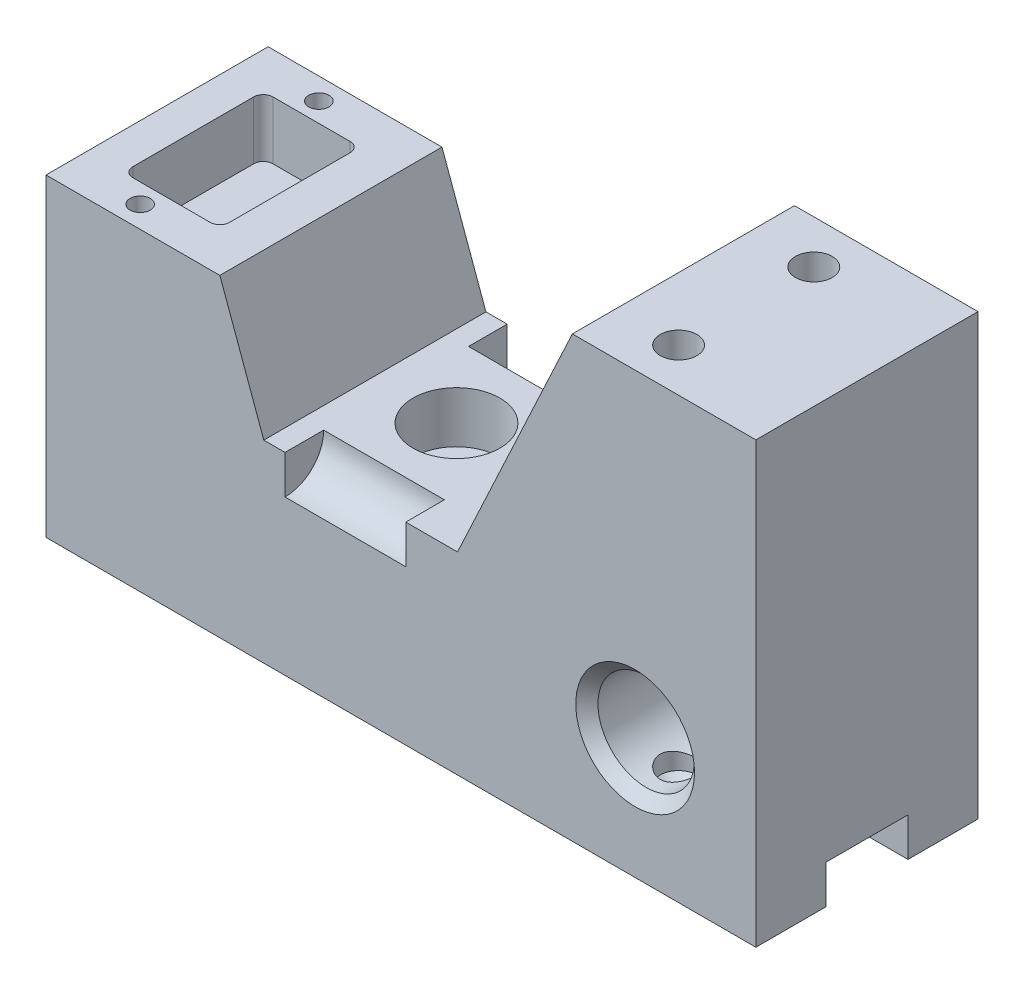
ISO-10303-21;
HEADER;
FILE_DESCRIPTION(('STEP AP214'),'2;1');
FILE_NAME('part.step','',(''),(''),'','','');
FILE_SCHEMA(('AUTOMOTIVE_DESIGN { 1 0 10303 214 1 1 1 1 }'));
ENDSEC;
DATA;
#1=APPLICATION_CONTEXT('core data for automotive mechanical design processes');
#2=APPLICATION_PROTOCOL_DEFINITION('international standard','automotive_design',2000,#1);
#3=PRODUCT_CONTEXT('',#1,'mechanical');
#4=PRODUCT('Part','Part','',(#3));
#5=PRODUCT_RELATED_PRODUCT_CATEGORY('part','',(#4));
#6=PRODUCT_DEFINITION_FORMATION('','',#4);
#7=PRODUCT_DEFINITION_CONTEXT('part definition',#1,'design');
#8=PRODUCT_DEFINITION('design','',#6,#7);
#9=PRODUCT_DEFINITION_SHAPE('','',#8);
#10=(LENGTH_UNIT() NAMED_UNIT(*) SI_UNIT(.MILLI.,.METRE.));
#11=(NAMED_UNIT(*) PLANE_ANGLE_UNIT() SI_UNIT($,.RADIAN.));
#12=(NAMED_UNIT(*) SI_UNIT($,.STERADIAN.) SOLID_ANGLE_UNIT());
#13=UNCERTAINTY_MEASURE_WITH_UNIT(LENGTH_MEASURE(1.E-05),#10,'distance_accuracy_value','');
#14=(GEOMETRIC_REPRESENTATION_CONTEXT(3) GLOBAL_UNCERTAINTY_ASSIGNED_CONTEXT((#13)) GLOBAL_UNIT_ASSIGNED_CONTEXT((#10,
#11,#12)) REPRESENTATION_CONTEXT('',''));
#15=CARTESIAN_POINT('',(0.,0.,0.));
#16=DIRECTION('',(0.,0.,1.));
#17=DIRECTION('',(1.,0.,0.));
#18=AXIS2_PLACEMENT_3D('',#15,#16,#17);
#19=CARTESIAN_POINT('',(45.0992558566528,40.,23.));
#20=DIRECTION('',(0.,-1.,0.));
#21=DIRECTION('',(1.,0.,0.));
#22=AXIS2_PLACEMENT_3D('',#19,#20,#21);
#23=PLANE('',#22);
#24=CARTESIAN_POINT('',(62.0000000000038,40.,0.));
#25=DIRECTION('',(0.,1.,0.));
#26=DIRECTION('',(0.,0.,1.));
#27=AXIS2_PLACEMENT_3D('',#24,#25,#26);
#28=CIRCLE('',#27,9.);
#29=CARTESIAN_POINT('',(62.0000000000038,40.,9.));
#30=VERTEX_POINT('',#29);
#31=EDGE_CURVE('E273',#30,#30,#28,.T.);
#32=ORIENTED_EDGE('',*,*,#31,.F.);
#33=EDGE_LOOP('',(#32));
#34=FACE_BOUND('',#33,.T.);
#35=DIRECTION('',(0.,0.,1.));
#36=VECTOR('',#35,1.);
#37=CARTESIAN_POINT('',(49.5000000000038,40.,23.));
#38=LINE('',#37,#36);
#39=CARTESIAN_POINT('',(49.5000000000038,40.,-23.));
#40=VERTEX_POINT('',#39);
#41=CARTESIAN_POINT('',(49.5000000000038,40.,-15.));
#42=VERTEX_POINT('',#41);
#43=EDGE_CURVE('E237',#40,#42,#38,.T.);
#44=ORIENTED_EDGE('',*,*,#43,.F.);
#45=DIRECTION('',(-1.,0.,0.));
#46=VECTOR('',#45,1.);
#47=CARTESIAN_POINT('',(45.0992558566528,40.,-23.));
#48=LINE('',#47,#46);
#49=CARTESIAN_POINT('',(45.0992558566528,40.,-23.));
#50=VERTEX_POINT('',#49);
#51=EDGE_CURVE('E379',#40,#50,#48,.T.);
#52=ORIENTED_EDGE('',*,*,#51,.T.);
#53=DIRECTION('',(0.,0.,-1.));
#54=VECTOR('',#53,1.);
#55=CARTESIAN_POINT('',(45.0992558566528,40.,23.));
#56=LINE('',#55,#54);
#57=CARTESIAN_POINT('',(45.0992558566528,40.,23.));
#58=VERTEX_POINT('',#57);
#59=EDGE_CURVE('E396',#58,#50,#56,.T.);
#60=ORIENTED_EDGE('',*,*,#59,.F.);
#61=DIRECTION('',(-1.,0.,0.));
#62=VECTOR('',#61,1.);
#63=CARTESIAN_POINT('',(45.0992558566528,40.,23.));
#64=LINE('',#63,#62);
#65=CARTESIAN_POINT('',(49.5000000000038,40.,23.));
#66=VERTEX_POINT('',#65);
#67=EDGE_CURVE('E360',#66,#58,#64,.T.);
#68=ORIENTED_EDGE('',*,*,#67,.F.);
#69=DIRECTION('',(0.,0.,1.));
#70=VECTOR('',#69,1.);
#71=CARTESIAN_POINT('',(49.5000000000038,40.,23.));
#72=LINE('',#71,#70);
#73=CARTESIAN_POINT('',(49.5000000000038,40.,15.));
#74=VERTEX_POINT('',#73);
#75=EDGE_CURVE('E700',#74,#66,#72,.T.);
#76=ORIENTED_EDGE('',*,*,#75,.F.);
#77=DIRECTION('',(1.,0.,0.));
#78=VECTOR('',#77,1.);
#79=CARTESIAN_POINT('',(49.5000000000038,40.,15.));
#80=LINE('',#79,#78);
#81=CARTESIAN_POINT('',(74.5000000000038,40.,15.));
#82=VERTEX_POINT('',#81);
#83=EDGE_CURVE('E697',#74,#82,#80,.T.);
#84=ORIENTED_EDGE('',*,*,#83,.T.);
#85=DIRECTION('',(0.,0.,1.));
#86=VECTOR('',#85,1.);
#87=CARTESIAN_POINT('',(74.5000000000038,40.,23.));
#88=LINE('',#87,#86);
#89=CARTESIAN_POINT('',(74.5000000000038,40.,23.));
#90=VERTEX_POINT('',#89);
#91=EDGE_CURVE('E459',#82,#90,#88,.T.);
#92=ORIENTED_EDGE('',*,*,#91,.T.);
#93=CARTESIAN_POINT('',(85.2183094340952,40.,23.));
#94=VERTEX_POINT('',#93);
#95=EDGE_CURVE('E361',#94,#90,#64,.T.);
#96=ORIENTED_EDGE('',*,*,#95,.F.);
#97=DIRECTION('',(0.,0.,-1.));
#98=VECTOR('',#97,1.);
#99=CARTESIAN_POINT('',(85.2183094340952,40.,23.));
#100=LINE('',#99,#98);
#101=CARTESIAN_POINT('',(85.2183094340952,40.,-23.));
#102=VERTEX_POINT('',#101);
#103=EDGE_CURVE('E399',#94,#102,#100,.T.);
#104=ORIENTED_EDGE('',*,*,#103,.T.);
#105=CARTESIAN_POINT('',(74.5000000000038,40.,-23.));
#106=VERTEX_POINT('',#105);
#107=EDGE_CURVE('E245',#102,#106,#48,.T.);
#108=ORIENTED_EDGE('',*,*,#107,.T.);
#109=DIRECTION('',(0.,0.,1.));
#110=VECTOR('',#109,1.);
#111=CARTESIAN_POINT('',(74.5000000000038,40.,23.));
#112=LINE('',#111,#110);
#113=CARTESIAN_POINT('',(74.5000000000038,40.,-15.));
#114=VERTEX_POINT('',#113);
#115=EDGE_CURVE('E55',#106,#114,#112,.T.);
#116=ORIENTED_EDGE('',*,*,#115,.T.);
#117=DIRECTION('',(1.,0.,0.));
#118=VECTOR('',#117,1.);
#119=CARTESIAN_POINT('',(49.5000000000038,40.,-15.));
#120=LINE('',#119,#118);
#121=EDGE_CURVE('E228',#42,#114,#120,.T.);
#122=ORIENTED_EDGE('',*,*,#121,.F.);
#123=EDGE_LOOP('',(#44,#52,#60,#68,#76,#84,#92,#96,#104,#108,#116,#122));
#124=FACE_BOUND('',#123,.T.);
#125=ADVANCED_FACE('F40',(#34,#124),#23,.F.);
#126=CARTESIAN_POINT('',(0.,0.,-23.));
#127=DIRECTION('',(0.,0.,-1.));
#128=DIRECTION('',(-1.,0.,0.));
#129=AXIS2_PLACEMENT_3D('',#126,#127,#128);
#130=PLANE('',#129);
#131=CARTESIAN_POINT('',(122.000000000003,25.,-23.));
#132=DIRECTION('',(0.,0.,-1.));
#133=DIRECTION('',(-1.,0.,0.));
#134=AXIS2_PLACEMENT_3D('',#131,#132,#133);
#135=CIRCLE('',#134,12.3);
#136=CARTESIAN_POINT('',(109.700000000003,25.,-23.));
#137=VERTEX_POINT('',#136);
#138=EDGE_CURVE('E411',#137,#137,#135,.F.);
#139=ORIENTED_EDGE('',*,*,#138,.T.);
#140=EDGE_LOOP('',(#139));
#141=FACE_BOUND('',#140,.T.);
#142=ORIENTED_EDGE('',*,*,#51,.F.);
#143=DIRECTION('',(0.,-1.,0.));
#144=VECTOR('',#143,1.);
#145=CARTESIAN_POINT('',(49.5000000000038,0.,-23.));
#146=LINE('',#145,#144);
#147=CARTESIAN_POINT('',(49.5000000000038,32.,-23.));
#148=VERTEX_POINT('',#147);
#149=EDGE_CURVE('E11',#40,#148,#146,.T.);
#150=ORIENTED_EDGE('',*,*,#149,.T.);
#151=DIRECTION('',(1.,0.,0.));
#152=VECTOR('',#151,1.);
#153=CARTESIAN_POINT('',(49.5000000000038,32.,-23.));
#154=LINE('',#153,#152);
#155=CARTESIAN_POINT('',(74.5000000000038,32.,-23.));
#156=VERTEX_POINT('',#155);
#157=EDGE_CURVE('E48',#148,#156,#154,.T.);
#158=ORIENTED_EDGE('',*,*,#157,.T.);
#159=DIRECTION('',(0.,-1.,0.));
#160=VECTOR('',#159,1.);
#161=CARTESIAN_POINT('',(74.5000000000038,0.,-23.));
#162=LINE('',#161,#160);
#163=EDGE_CURVE('E240',#106,#156,#162,.T.);
#164=ORIENTED_EDGE('',*,*,#163,.F.);
#165=ORIENTED_EDGE('',*,*,#107,.F.);
#166=DIRECTION('',(-0.422618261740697,-0.906307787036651,0.));
#167=VECTOR('',#166,1.);
#168=CARTESIAN_POINT('',(85.2183094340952,40.,-23.));
#169=LINE('',#168,#167);
#170=CARTESIAN_POINT('',(109.000000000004,91.0000000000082,-23.));
#171=VERTEX_POINT('',#170);
#172=EDGE_CURVE('E377',#171,#102,#169,.T.);
#173=ORIENTED_EDGE('',*,*,#172,.F.);
#174=DIRECTION('',(-1.,0.,0.));
#175=VECTOR('',#174,1.);
#176=CARTESIAN_POINT('',(109.000000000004,91.0000000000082,-23.));
#177=LINE('',#176,#175);
#178=CARTESIAN_POINT('',(147.000000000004,91.0000000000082,-23.));
#179=VERTEX_POINT('',#178);
#180=EDGE_CURVE('E375',#179,#171,#177,.T.);
#181=ORIENTED_EDGE('',*,*,#180,.F.);
#182=DIRECTION('',(0.,1.,0.));
#183=VECTOR('',#182,1.);
#184=CARTESIAN_POINT('',(147.000000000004,91.0000000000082,-23.));
#185=LINE('',#184,#183);
#186=CARTESIAN_POINT('',(147.000000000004,0.,-23.));
#187=VERTEX_POINT('',#186);
#188=EDGE_CURVE('E373',#187,#179,#185,.T.);
#189=ORIENTED_EDGE('',*,*,#188,.F.);
#190=DIRECTION('',(1.,0.,0.));
#191=VECTOR('',#190,1.);
#192=CARTESIAN_POINT('',(147.000000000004,0.,-23.));
#193=LINE('',#192,#191);
#194=CARTESIAN_POINT('',(0.,0.,-23.));
#195=VERTEX_POINT('',#194);
#196=EDGE_CURVE('E337',#195,#187,#193,.T.);
#197=ORIENTED_EDGE('',*,*,#196,.F.);
#198=DIRECTION('',(0.,-1.,0.));
#199=VECTOR('',#198,1.);
#200=CARTESIAN_POINT('',(0.,0.,-23.));
#201=LINE('',#200,#199);
#202=CARTESIAN_POINT('',(0.,65.,-23.));
#203=VERTEX_POINT('',#202);
#204=EDGE_CURVE('E354',#203,#195,#201,.T.);
#205=ORIENTED_EDGE('',*,*,#204,.F.);
#206=DIRECTION('',(-1.,0.,0.));
#207=VECTOR('',#206,1.);
#208=CARTESIAN_POINT('',(0.,65.,-23.));
#209=LINE('',#208,#207);
#210=CARTESIAN_POINT('',(35.9999999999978,65.,-23.));
#211=VERTEX_POINT('',#210);
#212=EDGE_CURVE('E383',#211,#203,#209,.T.);
#213=ORIENTED_EDGE('',*,*,#212,.F.);
#214=DIRECTION('',(-0.342020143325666,0.939692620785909,0.));
#215=VECTOR('',#214,1.);
#216=CARTESIAN_POINT('',(35.9999999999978,65.,-23.));
#217=LINE('',#216,#215);
#218=EDGE_CURVE('E381',#50,#211,#217,.T.);
#219=ORIENTED_EDGE('',*,*,#218,.F.);
#220=EDGE_LOOP('',(#142,#150,#158,#164,#165,#173,#181,#189,#197,#205,#213,#219));
#221=FACE_BOUND('',#220,.T.);
#222=ADVANCED_FACE('F516',(#141,#221),#130,.T.);
#223=CARTESIAN_POINT('',(0.,0.,23.));
#224=DIRECTION('',(0.,0.,-1.));
#225=DIRECTION('',(-1.,0.,0.));
#226=AXIS2_PLACEMENT_3D('',#223,#224,#225);
#227=PLANE('',#226);
#228=CARTESIAN_POINT('',(122.000000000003,25.,23.));
#229=DIRECTION('',(0.,0.,-1.));
#230=DIRECTION('',(-1.,0.,0.));
#231=AXIS2_PLACEMENT_3D('',#228,#229,#230);
#232=CIRCLE('',#231,12.3);
#233=CARTESIAN_POINT('',(134.300000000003,25.,23.));
#234=VERTEX_POINT('',#233);
#235=EDGE_CURVE('E420',#234,#234,#232,.T.);
#236=ORIENTED_EDGE('',*,*,#235,.T.);
#237=EDGE_LOOP('',(#236));
#238=FACE_BOUND('',#237,.T.);
#239=DIRECTION('',(0.,-1.,0.));
#240=VECTOR('',#239,1.);
#241=CARTESIAN_POINT('',(49.5000000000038,0.,23.));
#242=LINE('',#241,#240);
#243=CARTESIAN_POINT('',(49.5000000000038,32.,23.));
#244=VERTEX_POINT('',#243);
#245=EDGE_CURVE('E256',#66,#244,#242,.T.);
#246=ORIENTED_EDGE('',*,*,#245,.F.);
#247=ORIENTED_EDGE('',*,*,#67,.T.);
#248=DIRECTION('',(-0.342020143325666,0.939692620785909,0.));
#249=VECTOR('',#248,1.);
#250=CARTESIAN_POINT('',(35.9999999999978,65.,23.));
#251=LINE('',#250,#249);
#252=CARTESIAN_POINT('',(35.9999999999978,65.,23.));
#253=VERTEX_POINT('',#252);
#254=EDGE_CURVE('E364',#58,#253,#251,.T.);
#255=ORIENTED_EDGE('',*,*,#254,.T.);
#256=DIRECTION('',(-1.,0.,0.));
#257=VECTOR('',#256,1.);
#258=CARTESIAN_POINT('',(0.,65.,23.));
#259=LINE('',#258,#257);
#260=CARTESIAN_POINT('',(0.,65.,23.));
#261=VERTEX_POINT('',#260);
#262=EDGE_CURVE('E366',#253,#261,#259,.T.);
#263=ORIENTED_EDGE('',*,*,#262,.T.);
#264=DIRECTION('',(0.,-1.,0.));
#265=VECTOR('',#264,1.);
#266=CARTESIAN_POINT('',(0.,0.,23.));
#267=LINE('',#266,#265);
#268=CARTESIAN_POINT('',(0.,0.,23.));
#269=VERTEX_POINT('',#268);
#270=EDGE_CURVE('E368',#261,#269,#267,.T.);
#271=ORIENTED_EDGE('',*,*,#270,.T.);
#272=DIRECTION('',(1.,0.,0.));
#273=VECTOR('',#272,1.);
#274=CARTESIAN_POINT('',(147.000000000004,0.,23.));
#275=LINE('',#274,#273);
#276=CARTESIAN_POINT('',(147.000000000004,0.,23.));
#277=VERTEX_POINT('',#276);
#278=EDGE_CURVE('E350',#269,#277,#275,.T.);
#279=ORIENTED_EDGE('',*,*,#278,.T.);
#280=DIRECTION('',(0.,1.,0.));
#281=VECTOR('',#280,1.);
#282=CARTESIAN_POINT('',(147.000000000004,91.0000000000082,23.));
#283=LINE('',#282,#281);
#284=CARTESIAN_POINT('',(147.000000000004,91.0000000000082,23.));
#285=VERTEX_POINT('',#284);
#286=EDGE_CURVE('E353',#277,#285,#283,.T.);
#287=ORIENTED_EDGE('',*,*,#286,.T.);
#288=DIRECTION('',(-1.,0.,0.));
#289=VECTOR('',#288,1.);
#290=CARTESIAN_POINT('',(109.000000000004,91.0000000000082,23.));
#291=LINE('',#290,#289);
#292=CARTESIAN_POINT('',(109.000000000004,91.0000000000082,23.));
#293=VERTEX_POINT('',#292);
#294=EDGE_CURVE('E356',#285,#293,#291,.T.);
#295=ORIENTED_EDGE('',*,*,#294,.T.);
#296=DIRECTION('',(-0.422618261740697,-0.906307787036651,0.));
#297=VECTOR('',#296,1.);
#298=CARTESIAN_POINT('',(85.2183094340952,40.,23.));
#299=LINE('',#298,#297);
#300=EDGE_CURVE('E358',#293,#94,#299,.T.);
#301=ORIENTED_EDGE('',*,*,#300,.T.);
#302=ORIENTED_EDGE('',*,*,#95,.T.);
#303=DIRECTION('',(0.,-1.,0.));
#304=VECTOR('',#303,1.);
#305=CARTESIAN_POINT('',(74.5000000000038,0.,23.));
#306=LINE('',#305,#304);
#307=CARTESIAN_POINT('',(74.5000000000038,32.,23.));
#308=VERTEX_POINT('',#307);
#309=EDGE_CURVE('E63',#90,#308,#306,.T.);
#310=ORIENTED_EDGE('',*,*,#309,.T.);
#311=DIRECTION('',(1.,0.,0.));
#312=VECTOR('',#311,1.);
#313=CARTESIAN_POINT('',(49.5000000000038,32.,23.));
#314=LINE('',#313,#312);
#315=EDGE_CURVE('E258',#308,#244,#314,.F.);
#316=ORIENTED_EDGE('',*,*,#315,.T.);
#317=EDGE_LOOP('',(#246,#247,#255,#263,#271,#279,#287,#295,#301,#302,#310,#316));
#318=FACE_BOUND('',#317,.T.);
#319=ADVANCED_FACE('F522',(#238,#318),#227,.F.);
#320=CARTESIAN_POINT('',(147.000000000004,0.,23.));
#321=DIRECTION('',(0.,1.,0.));
#322=DIRECTION('',(-1.,0.,0.));
#323=AXIS2_PLACEMENT_3D('',#320,#321,#322);
#324=PLANE('',#323);
#325=DIRECTION('',(0.,0.,-1.));
#326=VECTOR('',#325,1.);
#327=CARTESIAN_POINT('',(147.000000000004,0.,23.));
#328=LINE('',#327,#326);
#329=CARTESIAN_POINT('',(147.000000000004,0.,-8.5));
#330=VERTEX_POINT('',#329);
#331=EDGE_CURVE('E407',#330,#187,#328,.T.);
#332=ORIENTED_EDGE('',*,*,#331,.F.);
#333=DIRECTION('',(1.,0.,0.));
#334=VECTOR('',#333,1.);
#335=CARTESIAN_POINT('',(0.,0.,-8.5));
#336=LINE('',#335,#334);
#337=CARTESIAN_POINT('',(0.,0.,-8.5));
#338=VERTEX_POINT('',#337);
#339=EDGE_CURVE('E301',#338,#330,#336,.T.);
#340=ORIENTED_EDGE('',*,*,#339,.F.);
#341=DIRECTION('',(0.,0.,-1.));
#342=VECTOR('',#341,1.);
#343=CARTESIAN_POINT('',(0.,0.,23.));
#344=LINE('',#343,#342);
#345=EDGE_CURVE('E370',#338,#195,#344,.T.);
#346=ORIENTED_EDGE('',*,*,#345,.T.);
#347=ORIENTED_EDGE('',*,*,#196,.T.);
#348=EDGE_LOOP('',(#332,#340,#346,#347));
#349=FACE_BOUND('',#348,.T.);
#350=ADVANCED_FACE('F545',(#349),#324,.F.);
#351=CARTESIAN_POINT('',(0.,0.,8.5));
#352=VERTEX_POINT('',#351);
#353=EDGE_CURVE('E387',#269,#352,#344,.T.);
#354=ORIENTED_EDGE('',*,*,#353,.T.);
#355=DIRECTION('',(1.,0.,0.));
#356=VECTOR('',#355,1.);
#357=CARTESIAN_POINT('',(0.,0.,8.5));
#358=LINE('',#357,#356);
#359=CARTESIAN_POINT('',(147.000000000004,0.,8.5));
#360=VERTEX_POINT('',#359);
#361=EDGE_CURVE('E304',#352,#360,#358,.T.);
#362=ORIENTED_EDGE('',*,*,#361,.T.);
#363=EDGE_CURVE('E408',#277,#360,#328,.T.);
#364=ORIENTED_EDGE('',*,*,#363,.F.);
#365=ORIENTED_EDGE('',*,*,#278,.F.);
#366=EDGE_LOOP('',(#354,#362,#364,#365));
#367=FACE_BOUND('',#366,.T.);
#368=ADVANCED_FACE('F541',(#367),#324,.F.);
#369=CARTESIAN_POINT('',(147.000000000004,91.0000000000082,23.));
#370=DIRECTION('',(-1.,0.,0.));
#371=DIRECTION('',(0.,0.,1.));
#372=AXIS2_PLACEMENT_3D('',#369,#370,#371);
#373=PLANE('',#372);
#374=DIRECTION('',(0.,0.,1.));
#375=VECTOR('',#374,1.);
#376=CARTESIAN_POINT('',(147.000000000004,8.,-8.5));
#377=LINE('',#376,#375);
#378=CARTESIAN_POINT('',(147.000000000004,8.,-8.5));
#379=VERTEX_POINT('',#378);
#380=CARTESIAN_POINT('',(147.000000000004,8.,8.5));
#381=VERTEX_POINT('',#380);
#382=EDGE_CURVE('E297',#379,#381,#377,.T.);
#383=ORIENTED_EDGE('',*,*,#382,.F.);
#384=DIRECTION('',(0.,1.,0.));
#385=VECTOR('',#384,1.);
#386=CARTESIAN_POINT('',(147.000000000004,0.,-8.5));
#387=LINE('',#386,#385);
#388=EDGE_CURVE('E294',#330,#379,#387,.T.);
#389=ORIENTED_EDGE('',*,*,#388,.F.);
#390=ORIENTED_EDGE('',*,*,#331,.T.);
#391=ORIENTED_EDGE('',*,*,#188,.T.);
#392=DIRECTION('',(0.,0.,-1.));
#393=VECTOR('',#392,1.);
#394=CARTESIAN_POINT('',(147.000000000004,91.0000000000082,23.));
#395=LINE('',#394,#393);
#396=EDGE_CURVE('E404',#285,#179,#395,.T.);
#397=ORIENTED_EDGE('',*,*,#396,.F.);
#398=ORIENTED_EDGE('',*,*,#286,.F.);
#399=ORIENTED_EDGE('',*,*,#363,.T.);
#400=DIRECTION('',(0.,-1.,0.));
#401=VECTOR('',#400,1.);
#402=CARTESIAN_POINT('',(147.000000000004,0.,8.5));
#403=LINE('',#402,#401);
#404=EDGE_CURVE('E287',#381,#360,#403,.T.);
#405=ORIENTED_EDGE('',*,*,#404,.F.);
#406=EDGE_LOOP('',(#383,#389,#390,#391,#397,#398,#399,#405));
#407=FACE_BOUND('',#406,.T.);
#408=ADVANCED_FACE('F537',(#407),#373,.F.);
#409=CARTESIAN_POINT('',(109.000000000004,91.0000000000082,23.));
#410=DIRECTION('',(0.,-1.,0.));
#411=DIRECTION('',(1.,0.,0.));
#412=AXIS2_PLACEMENT_3D('',#409,#410,#411);
#413=PLANE('',#412);
#414=CARTESIAN_POINT('',(122.000000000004,91.0000000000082,14.));
#415=DIRECTION('',(0.,1.,0.));
#416=DIRECTION('',(0.,0.,1.));
#417=AXIS2_PLACEMENT_3D('',#414,#415,#416);
#418=CIRCLE('',#417,3.8);
#419=CARTESIAN_POINT('',(122.000000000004,91.0000000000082,17.8));
#420=VERTEX_POINT('',#419);
#421=EDGE_CURVE('E303',#420,#420,#418,.T.);
#422=ORIENTED_EDGE('',*,*,#421,.F.);
#423=EDGE_LOOP('',(#422));
#424=FACE_BOUND('',#423,.T.);
#425=CARTESIAN_POINT('',(122.000000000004,91.0000000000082,-14.));
#426=DIRECTION('',(0.,1.,0.));
#427=DIRECTION('',(0.,0.,1.));
#428=AXIS2_PLACEMENT_3D('',#425,#426,#427);
#429=CIRCLE('',#428,3.8);
#430=CARTESIAN_POINT('',(122.000000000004,91.0000000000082,-10.2));
#431=VERTEX_POINT('',#430);
#432=EDGE_CURVE('E316',#431,#431,#429,.T.);
#433=ORIENTED_EDGE('',*,*,#432,.F.);
#434=EDGE_LOOP('',(#433));
#435=FACE_BOUND('',#434,.T.);
#436=ORIENTED_EDGE('',*,*,#180,.T.);
#437=DIRECTION('',(0.,0.,-1.));
#438=VECTOR('',#437,1.);
#439=CARTESIAN_POINT('',(109.000000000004,91.0000000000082,23.));
#440=LINE('',#439,#438);
#441=EDGE_CURVE('E401',#293,#171,#440,.T.);
#442=ORIENTED_EDGE('',*,*,#441,.F.);
#443=ORIENTED_EDGE('',*,*,#294,.F.);
#444=ORIENTED_EDGE('',*,*,#396,.T.);
#445=EDGE_LOOP('',(#436,#442,#443,#444));
#446=FACE_BOUND('',#445,.T.);
#447=ADVANCED_FACE('F533',(#424,#435,#446),#413,.F.);
#448=CARTESIAN_POINT('',(85.2183094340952,40.,23.));
#449=DIRECTION('',(0.906307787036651,-0.422618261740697,0.));
#450=DIRECTION('',(0.422618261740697,0.906307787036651,0.));
#451=AXIS2_PLACEMENT_3D('',#448,#449,#450);
#452=PLANE('',#451);
#453=ORIENTED_EDGE('',*,*,#172,.T.);
#454=ORIENTED_EDGE('',*,*,#103,.F.);
#455=ORIENTED_EDGE('',*,*,#300,.F.);
#456=ORIENTED_EDGE('',*,*,#441,.T.);
#457=EDGE_LOOP('',(#453,#454,#455,#456));
#458=FACE_BOUND('',#457,.T.);
#459=ADVANCED_FACE('F530',(#458),#452,.F.);
#460=CARTESIAN_POINT('',(35.9999999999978,65.,23.));
#461=DIRECTION('',(-0.939692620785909,-0.342020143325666,0.));
#462=DIRECTION('',(0.342020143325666,-0.939692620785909,0.));
#463=AXIS2_PLACEMENT_3D('',#460,#461,#462);
#464=PLANE('',#463);
#465=ORIENTED_EDGE('',*,*,#218,.T.);
#466=DIRECTION('',(0.,0.,-1.));
#467=VECTOR('',#466,1.);
#468=CARTESIAN_POINT('',(35.9999999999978,65.,23.));
#469=LINE('',#468,#467);
#470=EDGE_CURVE('E393',#253,#211,#469,.T.);
#471=ORIENTED_EDGE('',*,*,#470,.F.);
#472=ORIENTED_EDGE('',*,*,#254,.F.);
#473=ORIENTED_EDGE('',*,*,#59,.T.);
#474=EDGE_LOOP('',(#465,#471,#472,#473));
#475=FACE_BOUND('',#474,.T.);
#476=ADVANCED_FACE('F528',(#475),#464,.F.);
#477=CARTESIAN_POINT('',(0.,65.,23.));
#478=DIRECTION('',(0.,-1.,0.));
#479=DIRECTION('',(0.,0.,-1.));
#480=AXIS2_PLACEMENT_3D('',#477,#478,#479);
#481=PLANE('',#480);
#482=CARTESIAN_POINT('',(15.,65.,18.5));
#483=DIRECTION('',(0.,1.,0.));
#484=DIRECTION('',(0.,0.,1.));
#485=AXIS2_PLACEMENT_3D('',#482,#483,#484);
#486=CIRCLE('',#485,2.09999999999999);
#487=CARTESIAN_POINT('',(15.,65.,20.6));
#488=VERTEX_POINT('',#487);
#489=EDGE_CURVE('E261',#488,#488,#486,.T.);
#490=ORIENTED_EDGE('',*,*,#489,.F.);
#491=EDGE_LOOP('',(#490));
#492=FACE_BOUND('',#491,.T.);
#493=CARTESIAN_POINT('',(15.,65.,-18.5));
#494=DIRECTION('',(0.,1.,0.));
#495=DIRECTION('',(0.,0.,1.));
#496=AXIS2_PLACEMENT_3D('',#493,#494,#495);
#497=CIRCLE('',#496,2.09999999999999);
#498=CARTESIAN_POINT('',(15.,65.,-16.4));
#499=VERTEX_POINT('',#498);
#500=EDGE_CURVE('E267',#499,#499,#497,.T.);
#501=ORIENTED_EDGE('',*,*,#500,.F.);
#502=EDGE_LOOP('',(#501));
#503=FACE_BOUND('',#502,.T.);
#504=DIRECTION('',(-1.,0.,0.));
#505=VECTOR('',#504,1.);
#506=CARTESIAN_POINT('',(7.5,65.,-14.5));
#507=LINE('',#506,#505);
#508=CARTESIAN_POINT('',(25.5,65.,-14.5));
#509=VERTEX_POINT('',#508);
#510=CARTESIAN_POINT('',(9.5,65.,-14.5));
#511=VERTEX_POINT('',#510);
#512=EDGE_CURVE('E341',#509,#511,#507,.T.);
#513=ORIENTED_EDGE('',*,*,#512,.F.);
#514=CARTESIAN_POINT('',(25.5,65.,-12.5));
#515=DIRECTION('',(0.,-1.,0.));
#516=DIRECTION('',(0.,0.,-1.));
#517=AXIS2_PLACEMENT_3D('',#514,#515,#516);
#518=CIRCLE('',#517,2.);
#519=CARTESIAN_POINT('',(27.5,65.,-12.5));
#520=VERTEX_POINT('',#519);
#521=EDGE_CURVE('E455',#509,#520,#518,.T.);
#522=ORIENTED_EDGE('',*,*,#521,.T.);
#523=DIRECTION('',(0.,0.,-1.));
#524=VECTOR('',#523,1.);
#525=CARTESIAN_POINT('',(27.5,65.,-14.5));
#526=LINE('',#525,#524);
#527=CARTESIAN_POINT('',(27.5,65.,12.5));
#528=VERTEX_POINT('',#527);
#529=EDGE_CURVE('E338',#528,#520,#526,.T.);
#530=ORIENTED_EDGE('',*,*,#529,.F.);
#531=CARTESIAN_POINT('',(25.5,65.,12.5));
#532=DIRECTION('',(0.,-1.,0.));
#533=DIRECTION('',(0.,0.,-1.));
#534=AXIS2_PLACEMENT_3D('',#531,#532,#533);
#535=CIRCLE('',#534,2.);
#536=CARTESIAN_POINT('',(25.5,65.,14.5));
#537=VERTEX_POINT('',#536);
#538=EDGE_CURVE('E453',#528,#537,#535,.T.);
#539=ORIENTED_EDGE('',*,*,#538,.T.);
#540=DIRECTION('',(1.,0.,0.));
#541=VECTOR('',#540,1.);
#542=CARTESIAN_POINT('',(7.5,65.,14.5));
#543=LINE('',#542,#541);
#544=CARTESIAN_POINT('',(9.5,65.,14.5));
#545=VERTEX_POINT('',#544);
#546=EDGE_CURVE('E328',#545,#537,#543,.T.);
#547=ORIENTED_EDGE('',*,*,#546,.F.);
#548=CARTESIAN_POINT('',(9.5,65.,12.5));
#549=DIRECTION('',(0.,-1.,0.));
#550=DIRECTION('',(0.,0.,-1.));
#551=AXIS2_PLACEMENT_3D('',#548,#549,#550);
#552=CIRCLE('',#551,2.);
#553=CARTESIAN_POINT('',(7.5,65.,12.5));
#554=VERTEX_POINT('',#553);
#555=EDGE_CURVE('E451',#545,#554,#552,.T.);
#556=ORIENTED_EDGE('',*,*,#555,.T.);
#557=DIRECTION('',(0.,0.,1.));
#558=VECTOR('',#557,1.);
#559=CARTESIAN_POINT('',(7.5,65.,-14.5));
#560=LINE('',#559,#558);
#561=CARTESIAN_POINT('',(7.5,65.,-12.5));
#562=VERTEX_POINT('',#561);
#563=EDGE_CURVE('E345',#562,#554,#560,.T.);
#564=ORIENTED_EDGE('',*,*,#563,.F.);
#565=CARTESIAN_POINT('',(9.5,65.,-12.5));
#566=DIRECTION('',(0.,-1.,0.));
#567=DIRECTION('',(0.,0.,-1.));
#568=AXIS2_PLACEMENT_3D('',#565,#566,#567);
#569=CIRCLE('',#568,2.);
#570=EDGE_CURVE('E457',#562,#511,#569,.T.);
#571=ORIENTED_EDGE('',*,*,#570,.T.);
#572=EDGE_LOOP('',(#513,#522,#530,#539,#547,#556,#564,#571));
#573=FACE_BOUND('',#572,.T.);
#574=ORIENTED_EDGE('',*,*,#212,.T.);
#575=DIRECTION('',(0.,0.,-1.));
#576=VECTOR('',#575,1.);
#577=CARTESIAN_POINT('',(0.,65.,23.));
#578=LINE('',#577,#576);
#579=EDGE_CURVE('E390',#261,#203,#578,.T.);
#580=ORIENTED_EDGE('',*,*,#579,.F.);
#581=ORIENTED_EDGE('',*,*,#262,.F.);
#582=ORIENTED_EDGE('',*,*,#470,.T.);
#583=EDGE_LOOP('',(#574,#580,#581,#582));
#584=FACE_BOUND('',#583,.T.);
#585=ADVANCED_FACE('F583',(#492,#503,#573,#584),#481,.F.);
#586=CARTESIAN_POINT('',(0.,0.,23.));
#587=DIRECTION('',(1.,0.,0.));
#588=DIRECTION('',(0.,0.,-1.));
#589=AXIS2_PLACEMENT_3D('',#586,#587,#588);
#590=PLANE('',#589);
#591=ORIENTED_EDGE('',*,*,#345,.F.);
#592=DIRECTION('',(0.,1.,0.));
#593=VECTOR('',#592,1.);
#594=CARTESIAN_POINT('',(0.,0.,-8.5));
#595=LINE('',#594,#593);
#596=CARTESIAN_POINT('',(0.,8.00000000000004,-8.5));
#597=VERTEX_POINT('',#596);
#598=EDGE_CURVE('E283',#338,#597,#595,.T.);
#599=ORIENTED_EDGE('',*,*,#598,.T.);
#600=DIRECTION('',(0.,0.,1.));
#601=VECTOR('',#600,1.);
#602=CARTESIAN_POINT('',(0.,8.00000000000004,-8.5));
#603=LINE('',#602,#601);
#604=CARTESIAN_POINT('',(0.,8.00000000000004,8.5));
#605=VERTEX_POINT('',#604);
#606=EDGE_CURVE('E286',#597,#605,#603,.T.);
#607=ORIENTED_EDGE('',*,*,#606,.T.);
#608=DIRECTION('',(0.,-1.,0.));
#609=VECTOR('',#608,1.);
#610=CARTESIAN_POINT('',(0.,0.,8.5));
#611=LINE('',#610,#609);
#612=EDGE_CURVE('E290',#605,#352,#611,.T.);
#613=ORIENTED_EDGE('',*,*,#612,.T.);
#614=ORIENTED_EDGE('',*,*,#353,.F.);
#615=ORIENTED_EDGE('',*,*,#270,.F.);
#616=ORIENTED_EDGE('',*,*,#579,.T.);
#617=ORIENTED_EDGE('',*,*,#204,.T.);
#618=EDGE_LOOP('',(#591,#599,#607,#613,#614,#615,#616,#617));
#619=FACE_BOUND('',#618,.T.);
#620=ADVANCED_FACE('F586',(#619),#590,.F.);
#621=CARTESIAN_POINT('',(122.000000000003,25.,23.));
#622=DIRECTION('',(0.,0.,-1.));
#623=DIRECTION('',(-1.,0.,0.));
#624=AXIS2_PLACEMENT_3D('',#621,#622,#623);
#625=CYLINDRICAL_SURFACE('',#624,10.);
#626=CARTESIAN_POINT('',(122.000000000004,15.,17.8));
#627=CARTESIAN_POINT('',(122.102773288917,14.999999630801,17.8000004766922));
#628=CARTESIAN_POINT('',(122.205539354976,15.0015878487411,17.7958272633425));
#629=CARTESIAN_POINT('',(122.410333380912,15.0078968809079,17.7791777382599));
#630=CARTESIAN_POINT('',(122.512361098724,15.0126186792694,17.7666988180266));
#631=CARTESIAN_POINT('',(122.714838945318,15.0250673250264,17.733566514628));
#632=CARTESIAN_POINT('',(122.815289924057,15.032792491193,17.7129177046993));
#633=CARTESIAN_POINT('',(123.013971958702,15.0510381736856,17.6636533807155));
#634=CARTESIAN_POINT('',(123.112202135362,15.0615597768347,17.6350347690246));
#635=CARTESIAN_POINT('',(123.402076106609,15.0968763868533,17.5377351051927));
#636=CARTESIAN_POINT('',(123.589528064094,15.1254640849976,17.4575065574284));
#637=CARTESIAN_POINT('',(123.948185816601,15.1899078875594,17.2689026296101));
#638=CARTESIAN_POINT('',(124.119387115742,15.2257659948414,17.1605194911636));
#639=CARTESIAN_POINT('',(124.448265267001,15.3028038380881,16.9137386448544));
#640=CARTESIAN_POINT('',(124.60515012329,15.3441369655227,16.7743319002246));
#641=CARTESIAN_POINT('',(124.893948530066,15.4267207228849,16.4716107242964));
#642=CARTESIAN_POINT('',(125.025854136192,15.4679713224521,16.308288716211));
#643=CARTESIAN_POINT('',(125.266072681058,15.5475170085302,15.9545416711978));
#644=CARTESIAN_POINT('',(125.373253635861,15.5856320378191,15.7633032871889));
#645=CARTESIAN_POINT('',(125.553576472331,15.6521979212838,15.3638399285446));
#646=CARTESIAN_POINT('',(125.626732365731,15.6806527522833,15.1556219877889));
#647=CARTESIAN_POINT('',(125.73377865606,15.7230336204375,14.7372498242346));
#648=CARTESIAN_POINT('',(125.769185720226,15.7375184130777,14.5275422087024));
#649=CARTESIAN_POINT('',(125.804470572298,15.7519513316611,14.1047001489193));
#650=CARTESIAN_POINT('',(125.80436354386,15.7519056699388,13.8915672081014));
#651=CARTESIAN_POINT('',(125.769780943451,15.7377635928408,13.4819335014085));
#652=CARTESIAN_POINT('',(125.737426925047,15.7245345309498,13.285218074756));
#653=CARTESIAN_POINT('',(125.64278192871,15.6869604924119,12.9002524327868));
#654=CARTESIAN_POINT('',(125.580486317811,15.6626137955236,12.7120035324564));
#655=CARTESIAN_POINT('',(125.426588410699,15.6050370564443,12.3450525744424));
#656=CARTESIAN_POINT('',(125.334445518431,15.5716451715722,12.1666037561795));
#657=CARTESIAN_POINT('',(125.123845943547,15.4997925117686,11.8270922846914));
#658=CARTESIAN_POINT('',(125.005380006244,15.4613299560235,11.666035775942));
#659=CARTESIAN_POINT('',(124.7358533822,15.3804258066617,11.354162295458));
#660=CARTESIAN_POINT('',(124.583105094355,15.3378929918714,11.2048238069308));
#661=CARTESIAN_POINT('',(124.254249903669,15.2559225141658,10.9334361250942));
#662=CARTESIAN_POINT('',(124.07813922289,15.2164853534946,10.8113913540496));
#663=CARTESIAN_POINT('',(123.703704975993,15.1443277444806,10.5963658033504));
#664=CARTESIAN_POINT('',(123.505066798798,15.1117269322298,10.5038898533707));
#665=CARTESIAN_POINT('',(123.093504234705,15.0578058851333,10.3541616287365));
#666=CARTESIAN_POINT('',(122.880586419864,15.0364805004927,10.2968932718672));
#667=CARTESIAN_POINT('',(122.458941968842,15.0084248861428,10.2220770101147));
#668=CARTESIAN_POINT('',(122.250616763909,15.0009642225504,10.2025389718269));
#669=CARTESIAN_POINT('',(121.833554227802,14.9992128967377,10.197927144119));
#670=CARTESIAN_POINT('',(121.624817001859,15.0049192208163,10.2128454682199));
#671=CARTESIAN_POINT('',(121.221537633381,15.028379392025,10.2752194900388));
#672=CARTESIAN_POINT('',(121.026760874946,15.0456462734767,10.3213607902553));
#673=CARTESIAN_POINT('',(120.647858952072,15.0899985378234,10.4431290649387));
#674=CARTESIAN_POINT('',(120.463735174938,15.1170851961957,10.5187598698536));
#675=CARTESIAN_POINT('',(120.105239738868,15.1794101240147,10.6997873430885));
#676=CARTESIAN_POINT('',(119.93131944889,15.2148663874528,10.8060005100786));
#677=CARTESIAN_POINT('',(119.603181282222,15.2900235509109,11.0442583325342));
#678=CARTESIAN_POINT('',(119.448970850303,15.3297260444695,11.1763127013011));
#679=CARTESIAN_POINT('',(119.155010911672,15.4119493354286,11.4717594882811));
#680=CARTESIAN_POINT('',(119.016670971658,15.4544970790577,11.636550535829));
#681=CARTESIAN_POINT('',(118.769316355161,15.535346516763,11.9878299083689));
#682=CARTESIAN_POINT('',(118.660304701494,15.5736477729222,12.1743204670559));
#683=CARTESIAN_POINT('',(118.474487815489,15.6415464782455,12.565475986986));
#684=CARTESIAN_POINT('',(118.397850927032,15.6710981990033,12.7702294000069));
#685=CARTESIAN_POINT('',(118.280664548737,15.7171887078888,13.1911768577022));
#686=CARTESIAN_POINT('',(118.240091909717,15.7337358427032,13.4073634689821));
#687=CARTESIAN_POINT('',(118.198283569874,15.7508155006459,13.8297210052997));
#688=CARTESIAN_POINT('',(118.19463589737,15.7523298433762,14.0356153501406));
#689=CARTESIAN_POINT('',(118.220571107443,15.741700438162,14.4449210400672));
#690=CARTESIAN_POINT('',(118.250150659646,15.7295580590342,14.6483326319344));
#691=CARTESIAN_POINT('',(118.339804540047,15.6938103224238,15.0402398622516));
#692=CARTESIAN_POINT('',(118.398866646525,15.6705865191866,15.2290048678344));
#693=CARTESIAN_POINT('',(118.54490451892,15.6155246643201,15.594049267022));
#694=CARTESIAN_POINT('',(118.63188742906,15.5836844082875,15.770325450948));
#695=CARTESIAN_POINT('',(118.836695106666,15.5128605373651,16.1156357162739));
#696=CARTESIAN_POINT('',(118.95591925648,15.473586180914,16.2837798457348));
#697=CARTESIAN_POINT('',(119.219647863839,15.3933016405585,16.5984308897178));
#698=CARTESIAN_POINT('',(119.364160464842,15.3522909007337,16.7449308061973));
#699=CARTESIAN_POINT('',(119.68419801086,15.2703688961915,17.0206020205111));
#700=CARTESIAN_POINT('',(119.861008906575,15.2295925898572,17.148337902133));
#701=CARTESIAN_POINT('',(120.141293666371,15.1737920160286,17.3161923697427));
#702=CARTESIAN_POINT('',(120.237300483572,15.1560760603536,17.3682116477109));
#703=CARTESIAN_POINT('',(120.433741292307,15.1229189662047,17.4639210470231));
#704=CARTESIAN_POINT('',(120.534173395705,15.1074768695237,17.5076146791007));
#705=CARTESIAN_POINT('',(120.744432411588,15.0785369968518,17.5884441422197));
#706=CARTESIAN_POINT('',(120.854471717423,15.0651939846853,17.6250836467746));
#707=CARTESIAN_POINT('',(121.077735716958,15.0419873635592,17.68820794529));
#708=CARTESIAN_POINT('',(121.190958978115,15.0321222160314,17.7146972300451));
#709=CARTESIAN_POINT('',(121.419595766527,15.0162001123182,17.7572129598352));
#710=CARTESIAN_POINT('',(121.535008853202,15.0101423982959,17.7732414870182));
#711=CARTESIAN_POINT('',(121.76695115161,15.0020428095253,17.7946340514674));
#712=CARTESIAN_POINT('',(121.883480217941,15.0000004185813,17.7999994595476));
#713=CARTESIAN_POINT('',(122.000000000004,15.,17.8));
#714=B_SPLINE_CURVE_WITH_KNOTS('',3,(#626,#627,#628,#629,#630,#631,#632,#633,#634,#635,#636,
#637,#638,#639,#640,#641,#642,#643,#644,#645,#646,#647,#648,#649,#650,#651,#652,#653,#654,#655,
#656,#657,#658,#659,#660,#661,#662,#663,#664,#665,#666,#667,#668,#669,#670,#671,#672,#673,#674,
#675,#676,#677,#678,#679,#680,#681,#682,#683,#684,#685,#686,#687,#688,#689,#690,#691,#692,#693,
#694,#695,#696,#697,#698,#699,#700,#701,#702,#703,#704,#705,#706,#707,#708,#709,#710,#711,#712,
#713),.UNSPECIFIED.,.T.,.F.,(4,2,2,2,2,2,2,2,2,2,2,2,2,2,2,2,2,2,2,2,2,2,2,2,2,2,2,2,2,2,2,2,2,
2,2,2,2,2,2,2,2,2,2,4),(0.,0.308210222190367,0.616517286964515,0.924652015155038,
1.23290667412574,1.84753626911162,2.46233541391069,3.1012064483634,3.74028032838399,
4.40448985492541,5.06842561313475,5.70454494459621,6.34039231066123,6.93699666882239,
7.53369337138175,8.14186599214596,8.75025277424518,9.40071496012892,10.0512824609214,
10.7124278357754,11.3732709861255,11.9981875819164,12.6229611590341,13.2229469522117,
13.8230107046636,14.4408765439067,15.0589750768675,15.71391069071,16.3689137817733,
17.027282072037,17.685227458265,18.2998942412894,18.9144994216,19.5093215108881,
20.1042959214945,20.7310547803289,21.3580158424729,22.0201905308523,22.3517081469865,
22.6830856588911,23.0327901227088,23.3823396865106,23.7318196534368,24.081254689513),.UNSPECIFIED.);
#715=CARTESIAN_POINT('',(122.000000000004,15.,17.8));
#716=VERTEX_POINT('',#715);
#717=EDGE_CURVE('E320',#716,#716,#714,.T.);
#718=ORIENTED_EDGE('',*,*,#717,.F.);
#719=EDGE_LOOP('',(#718));
#720=FACE_BOUND('',#719,.T.);
#721=CARTESIAN_POINT('',(122.000000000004,35.,17.8));
#722=CARTESIAN_POINT('',(121.897226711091,35.000000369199,17.8000004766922));
#723=CARTESIAN_POINT('',(121.794460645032,34.9984121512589,17.7958272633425));
#724=CARTESIAN_POINT('',(121.589666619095,34.9921031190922,17.7791777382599));
#725=CARTESIAN_POINT('',(121.487638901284,34.9873813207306,17.7666988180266));
#726=CARTESIAN_POINT('',(121.28516105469,34.9749326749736,17.733566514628));
#727=CARTESIAN_POINT('',(121.184710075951,34.967207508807,17.7129177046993));
#728=CARTESIAN_POINT('',(120.986028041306,34.9489618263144,17.6636533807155));
#729=CARTESIAN_POINT('',(120.887797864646,34.9384402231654,17.6350347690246));
#730=CARTESIAN_POINT('',(120.597923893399,34.9031236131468,17.5377351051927));
#731=CARTESIAN_POINT('',(120.410471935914,34.8745359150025,17.4575065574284));
#732=CARTESIAN_POINT('',(120.051814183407,34.8100921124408,17.2689026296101));
#733=CARTESIAN_POINT('',(119.880612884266,34.7742340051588,17.1605194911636));
#734=CARTESIAN_POINT('',(119.551734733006,34.6971961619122,16.9137386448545));
#735=CARTESIAN_POINT('',(119.394849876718,34.6558630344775,16.7743319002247));
#736=CARTESIAN_POINT('',(119.106051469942,34.5732792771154,16.4716107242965));
#737=CARTESIAN_POINT('',(118.974145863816,34.5320286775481,16.308288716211));
#738=CARTESIAN_POINT('',(118.73392731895,34.4524829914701,15.9545416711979));
#739=CARTESIAN_POINT('',(118.626746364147,34.4143679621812,15.7633032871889));
#740=CARTESIAN_POINT('',(118.446423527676,34.3478020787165,15.3638399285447));
#741=CARTESIAN_POINT('',(118.373267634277,34.319347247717,15.155621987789));
#742=CARTESIAN_POINT('',(118.266221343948,34.2769663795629,14.7372498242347));
#743=CARTESIAN_POINT('',(118.230814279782,34.2624815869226,14.5275422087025));
#744=CARTESIAN_POINT('',(118.195529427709,34.2480486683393,14.1047001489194));
#745=CARTESIAN_POINT('',(118.195636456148,34.2480943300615,13.8915672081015));
#746=CARTESIAN_POINT('',(118.230219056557,34.2622364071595,13.4819335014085));
#747=CARTESIAN_POINT('',(118.262573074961,34.2754654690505,13.285218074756));
#748=CARTESIAN_POINT('',(118.357218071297,34.3130395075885,12.9002524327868));
#749=CARTESIAN_POINT('',(118.419513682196,34.3373862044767,12.7120035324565));
#750=CARTESIAN_POINT('',(118.573411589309,34.394962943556,12.3450525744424));
#751=CARTESIAN_POINT('',(118.665554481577,34.4283548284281,12.1666037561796));
#752=CARTESIAN_POINT('',(118.876154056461,34.5002074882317,11.8270922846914));
#753=CARTESIAN_POINT('',(118.994619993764,34.5386700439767,11.666035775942));
#754=CARTESIAN_POINT('',(119.264146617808,34.6195741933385,11.354162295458));
#755=CARTESIAN_POINT('',(119.416894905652,34.6621070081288,11.2048238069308));
#756=CARTESIAN_POINT('',(119.745750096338,34.7440774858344,10.9334361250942));
#757=CARTESIAN_POINT('',(119.921860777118,34.7835146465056,10.8113913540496));
#758=CARTESIAN_POINT('',(120.296295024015,34.8556722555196,10.5963658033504));
#759=CARTESIAN_POINT('',(120.49493320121,34.8882730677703,10.5038898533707));
#760=CARTESIAN_POINT('',(120.906495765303,34.9421941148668,10.3541616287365));
#761=CARTESIAN_POINT('',(121.119413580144,34.9635194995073,10.2968932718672));
#762=CARTESIAN_POINT('',(121.541058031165,34.9915751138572,10.2220770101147));
#763=CARTESIAN_POINT('',(121.749383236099,34.9990357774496,10.2025389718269));
#764=CARTESIAN_POINT('',(122.166445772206,35.0007871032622,10.197927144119));
#765=CARTESIAN_POINT('',(122.375182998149,34.9950807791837,10.2128454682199));
#766=CARTESIAN_POINT('',(122.778462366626,34.9716206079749,10.2752194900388));
#767=CARTESIAN_POINT('',(122.973239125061,34.9543537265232,10.3213607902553));
#768=CARTESIAN_POINT('',(123.352141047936,34.9100014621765,10.4431290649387));
#769=CARTESIAN_POINT('',(123.53626482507,34.8829148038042,10.5187598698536));
#770=CARTESIAN_POINT('',(123.89476026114,34.8205898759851,10.6997873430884));
#771=CARTESIAN_POINT('',(124.068680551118,34.785133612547,10.8060005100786));
#772=CARTESIAN_POINT('',(124.396818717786,34.7099764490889,11.0442583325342));
#773=CARTESIAN_POINT('',(124.551029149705,34.6702739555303,11.1763127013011));
#774=CARTESIAN_POINT('',(124.844989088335,34.5880506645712,11.471759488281));
#775=CARTESIAN_POINT('',(124.98332902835,34.5455029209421,11.6365505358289));
#776=CARTESIAN_POINT('',(125.230683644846,34.4646534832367,11.9878299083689));
#777=CARTESIAN_POINT('',(125.339695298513,34.4263522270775,12.1743204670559));
#778=CARTESIAN_POINT('',(125.525512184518,34.3584535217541,12.565475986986));
#779=CARTESIAN_POINT('',(125.602149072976,34.3289018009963,12.7702294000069));
#780=CARTESIAN_POINT('',(125.71933545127,34.2828112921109,13.1911768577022));
#781=CARTESIAN_POINT('',(125.75990809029,34.2662641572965,13.4073634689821));
#782=CARTESIAN_POINT('',(125.801716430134,34.2491844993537,13.8297210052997));
#783=CARTESIAN_POINT('',(125.805364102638,34.2476701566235,14.0356153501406));
#784=CARTESIAN_POINT('',(125.779428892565,34.2582995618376,14.4449210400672));
#785=CARTESIAN_POINT('',(125.749849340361,34.2704419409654,14.6483326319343));
#786=CARTESIAN_POINT('',(125.66019545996,34.3061896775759,15.0402398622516));
#787=CARTESIAN_POINT('',(125.601133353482,34.3294134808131,15.2290048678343));
#788=CARTESIAN_POINT('',(125.455095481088,34.3844753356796,15.5940492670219));
#789=CARTESIAN_POINT('',(125.368112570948,34.4163155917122,15.7703254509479));
#790=CARTESIAN_POINT('',(125.163304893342,34.4871394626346,16.1156357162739));
#791=CARTESIAN_POINT('',(125.044080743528,34.5264138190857,16.2837798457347));
#792=CARTESIAN_POINT('',(124.780352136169,34.6066983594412,16.5984308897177));
#793=CARTESIAN_POINT('',(124.635839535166,34.647709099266,16.7449308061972));
#794=CARTESIAN_POINT('',(124.315801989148,34.7296311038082,17.020602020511));
#795=CARTESIAN_POINT('',(124.138991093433,34.7704074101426,17.1483379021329));
#796=CARTESIAN_POINT('',(123.858706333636,34.8262079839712,17.3161923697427));
#797=CARTESIAN_POINT('',(123.762699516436,34.8439239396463,17.3682116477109));
#798=CARTESIAN_POINT('',(123.566258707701,34.8770810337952,17.4639210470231));
#799=CARTESIAN_POINT('',(123.465826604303,34.8925231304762,17.5076146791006));
#800=CARTESIAN_POINT('',(123.255567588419,34.9214630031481,17.5884441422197));
#801=CARTESIAN_POINT('',(123.145528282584,34.9348060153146,17.6250836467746));
#802=CARTESIAN_POINT('',(122.922264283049,34.9580126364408,17.68820794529));
#803=CARTESIAN_POINT('',(122.809041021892,34.9678777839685,17.7146972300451));
#804=CARTESIAN_POINT('',(122.58040423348,34.9837998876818,17.7572129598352));
#805=CARTESIAN_POINT('',(122.464991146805,34.9898576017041,17.7732414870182));
#806=CARTESIAN_POINT('',(122.233048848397,34.9979571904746,17.7946340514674));
#807=CARTESIAN_POINT('',(122.116519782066,34.9999995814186,17.7999994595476));
#808=CARTESIAN_POINT('',(122.000000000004,35.,17.8));
#809=B_SPLINE_CURVE_WITH_KNOTS('',3,(#721,#722,#723,#724,#725,#726,#727,#728,#729,#730,#731,
#732,#733,#734,#735,#736,#737,#738,#739,#740,#741,#742,#743,#744,#745,#746,#747,#748,#749,#750,
#751,#752,#753,#754,#755,#756,#757,#758,#759,#760,#761,#762,#763,#764,#765,#766,#767,#768,#769,
#770,#771,#772,#773,#774,#775,#776,#777,#778,#779,#780,#781,#782,#783,#784,#785,#786,#787,#788,
#789,#790,#791,#792,#793,#794,#795,#796,#797,#798,#799,#800,#801,#802,#803,#804,#805,#806,#807,
#808),.UNSPECIFIED.,.T.,.F.,(4,2,2,2,2,2,2,2,2,2,2,2,2,2,2,2,2,2,2,2,2,2,2,2,2,2,2,2,2,2,2,2,2,
2,2,2,2,2,2,2,2,2,2,4),(0.,0.308210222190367,0.616517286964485,0.924652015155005,
1.2329066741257,1.84753626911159,2.46233541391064,3.10120644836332,3.74028032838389,
4.40448985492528,5.0684256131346,5.70454494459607,6.3403923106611,6.93699666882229,
7.53369337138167,8.14186599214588,8.75025277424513,9.40071496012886,10.0512824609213,
10.7124278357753,11.3732709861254,11.9981875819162,12.6229611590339,13.2229469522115,
13.8230107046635,14.4408765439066,15.0589750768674,15.7139106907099,16.3689137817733,
17.027282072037,17.685227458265,18.2998942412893,18.9144994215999,19.509321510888,
20.1042959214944,20.7310547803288,21.3580158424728,22.0201905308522,22.3517081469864,
22.6830856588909,23.0327901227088,23.3823396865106,23.7318196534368,24.081254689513),.UNSPECIFIED.);
#810=CARTESIAN_POINT('',(122.000000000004,35.,17.8));
#811=VERTEX_POINT('',#810);
#812=EDGE_CURVE('E315',#811,#811,#809,.T.);
#813=ORIENTED_EDGE('',*,*,#812,.F.);
#814=EDGE_LOOP('',(#813));
#815=FACE_BOUND('',#814,.T.);
#816=CARTESIAN_POINT('',(122.000000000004,15.,-10.2));
#817=CARTESIAN_POINT('',(122.102773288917,14.999999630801,-10.1999995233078));
#818=CARTESIAN_POINT('',(122.205539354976,15.0015878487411,-10.2041727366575));
#819=CARTESIAN_POINT('',(122.410333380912,15.0078968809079,-10.2208222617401));
#820=CARTESIAN_POINT('',(122.512361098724,15.0126186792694,-10.2333011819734));
#821=CARTESIAN_POINT('',(122.714838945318,15.0250673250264,-10.266433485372));
#822=CARTESIAN_POINT('',(122.815289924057,15.032792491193,-10.2870822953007));
#823=CARTESIAN_POINT('',(123.013971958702,15.0510381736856,-10.3363466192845));
#824=CARTESIAN_POINT('',(123.112202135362,15.0615597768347,-10.3649652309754));
#825=CARTESIAN_POINT('',(123.402076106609,15.0968763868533,-10.4622648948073));
#826=CARTESIAN_POINT('',(123.589528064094,15.1254640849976,-10.5424934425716));
#827=CARTESIAN_POINT('',(123.948185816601,15.1899078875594,-10.7310973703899));
#828=CARTESIAN_POINT('',(124.119387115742,15.2257659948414,-10.8394805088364));
#829=CARTESIAN_POINT('',(124.448265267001,15.3028038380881,-11.0862613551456));
#830=CARTESIAN_POINT('',(124.60515012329,15.3441369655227,-11.2256680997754));
#831=CARTESIAN_POINT('',(124.893948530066,15.4267207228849,-11.5283892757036));
#832=CARTESIAN_POINT('',(125.025854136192,15.4679713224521,-11.691711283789));
#833=CARTESIAN_POINT('',(125.266072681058,15.5475170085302,-12.0454583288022));
#834=CARTESIAN_POINT('',(125.373253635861,15.5856320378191,-12.2366967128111));
#835=CARTESIAN_POINT('',(125.553576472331,15.6521979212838,-12.6361600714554));
#836=CARTESIAN_POINT('',(125.626732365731,15.6806527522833,-12.8443780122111));
#837=CARTESIAN_POINT('',(125.73377865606,15.7230336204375,-13.2627501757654));
#838=CARTESIAN_POINT('',(125.769185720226,15.7375184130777,-13.4724577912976));
#839=CARTESIAN_POINT('',(125.804470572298,15.7519513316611,-13.8952998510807));
#840=CARTESIAN_POINT('',(125.80436354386,15.7519056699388,-14.1084327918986));
#841=CARTESIAN_POINT('',(125.769780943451,15.7377635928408,-14.5180664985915));
#842=CARTESIAN_POINT('',(125.737426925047,15.7245345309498,-14.714781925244));
#843=CARTESIAN_POINT('',(125.64278192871,15.6869604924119,-15.0997475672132));
#844=CARTESIAN_POINT('',(125.580486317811,15.6626137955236,-15.2879964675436));
#845=CARTESIAN_POINT('',(125.426588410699,15.6050370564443,-15.6549474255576));
#846=CARTESIAN_POINT('',(125.334445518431,15.5716451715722,-15.8333962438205));
#847=CARTESIAN_POINT('',(125.123845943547,15.4997925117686,-16.1729077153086));
#848=CARTESIAN_POINT('',(125.005380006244,15.4613299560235,-16.333964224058));
#849=CARTESIAN_POINT('',(124.7358533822,15.3804258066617,-16.645837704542));
#850=CARTESIAN_POINT('',(124.583105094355,15.3378929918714,-16.7951761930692));
#851=CARTESIAN_POINT('',(124.254249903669,15.2559225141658,-17.0665638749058));
#852=CARTESIAN_POINT('',(124.07813922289,15.2164853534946,-17.1886086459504));
#853=CARTESIAN_POINT('',(123.703704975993,15.1443277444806,-17.4036341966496));
#854=CARTESIAN_POINT('',(123.505066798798,15.1117269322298,-17.4961101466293));
#855=CARTESIAN_POINT('',(123.093504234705,15.0578058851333,-17.6458383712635));
#856=CARTESIAN_POINT('',(122.880586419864,15.0364805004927,-17.7031067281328));
#857=CARTESIAN_POINT('',(122.458941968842,15.0084248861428,-17.7779229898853));
#858=CARTESIAN_POINT('',(122.250616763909,15.0009642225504,-17.7974610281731));
#859=CARTESIAN_POINT('',(121.833554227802,14.9992128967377,-17.802072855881));
#860=CARTESIAN_POINT('',(121.624817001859,15.0049192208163,-17.7871545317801));
#861=CARTESIAN_POINT('',(121.221537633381,15.028379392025,-17.7247805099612));
#862=CARTESIAN_POINT('',(121.026760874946,15.0456462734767,-17.6786392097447));
#863=CARTESIAN_POINT('',(120.647858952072,15.0899985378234,-17.5568709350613));
#864=CARTESIAN_POINT('',(120.463735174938,15.1170851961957,-17.4812401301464));
#865=CARTESIAN_POINT('',(120.105239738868,15.1794101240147,-17.3002126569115));
#866=CARTESIAN_POINT('',(119.93131944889,15.2148663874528,-17.1939994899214));
#867=CARTESIAN_POINT('',(119.603181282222,15.2900235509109,-16.9557416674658));
#868=CARTESIAN_POINT('',(119.448970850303,15.3297260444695,-16.8236872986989));
#869=CARTESIAN_POINT('',(119.155010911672,15.4119493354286,-16.5282405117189));
#870=CARTESIAN_POINT('',(119.016670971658,15.4544970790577,-16.363449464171));
#871=CARTESIAN_POINT('',(118.769316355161,15.535346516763,-16.0121700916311));
#872=CARTESIAN_POINT('',(118.660304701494,15.5736477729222,-15.8256795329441));
#873=CARTESIAN_POINT('',(118.474487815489,15.6415464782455,-15.434524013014));
#874=CARTESIAN_POINT('',(118.397850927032,15.6710981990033,-15.2297705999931));
#875=CARTESIAN_POINT('',(118.280664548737,15.7171887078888,-14.8088231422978));
#876=CARTESIAN_POINT('',(118.240091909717,15.7337358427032,-14.5926365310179));
#877=CARTESIAN_POINT('',(118.198283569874,15.7508155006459,-14.1702789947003));
#878=CARTESIAN_POINT('',(118.19463589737,15.7523298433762,-13.9643846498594));
#879=CARTESIAN_POINT('',(118.220571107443,15.741700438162,-13.5550789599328));
#880=CARTESIAN_POINT('',(118.250150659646,15.7295580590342,-13.3516673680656));
#881=CARTESIAN_POINT('',(118.339804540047,15.6938103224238,-12.9597601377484));
#882=CARTESIAN_POINT('',(118.398866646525,15.6705865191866,-12.7709951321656));
#883=CARTESIAN_POINT('',(118.54490451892,15.6155246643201,-12.405950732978));
#884=CARTESIAN_POINT('',(118.63188742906,15.5836844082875,-12.229674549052));
#885=CARTESIAN_POINT('',(118.836695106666,15.5128605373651,-11.8843642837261));
#886=CARTESIAN_POINT('',(118.95591925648,15.473586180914,-11.7162201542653));
#887=CARTESIAN_POINT('',(119.219647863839,15.3933016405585,-11.4015691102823));
#888=CARTESIAN_POINT('',(119.364160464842,15.3522909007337,-11.2550691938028));
#889=CARTESIAN_POINT('',(119.68419801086,15.2703688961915,-10.9793979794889));
#890=CARTESIAN_POINT('',(119.861008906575,15.2295925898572,-10.851662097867));
#891=CARTESIAN_POINT('',(120.141293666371,15.1737920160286,-10.6838076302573));
#892=CARTESIAN_POINT('',(120.237300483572,15.1560760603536,-10.6317883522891));
#893=CARTESIAN_POINT('',(120.433741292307,15.1229189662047,-10.5360789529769));
#894=CARTESIAN_POINT('',(120.534173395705,15.1074768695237,-10.4923853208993));
#895=CARTESIAN_POINT('',(120.744432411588,15.0785369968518,-10.4115558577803));
#896=CARTESIAN_POINT('',(120.854471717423,15.0651939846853,-10.3749163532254));
#897=CARTESIAN_POINT('',(121.077735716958,15.0419873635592,-10.31179205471));
#898=CARTESIAN_POINT('',(121.190958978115,15.0321222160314,-10.2853027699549));
#899=CARTESIAN_POINT('',(121.419595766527,15.0162001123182,-10.2427870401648));
#900=CARTESIAN_POINT('',(121.535008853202,15.0101423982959,-10.2267585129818));
#901=CARTESIAN_POINT('',(121.76695115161,15.0020428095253,-10.2053659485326));
#902=CARTESIAN_POINT('',(121.883480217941,15.0000004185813,-10.2000005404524));
#903=CARTESIAN_POINT('',(122.000000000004,15.,-10.2));
#904=B_SPLINE_CURVE_WITH_KNOTS('',3,(#816,#817,#818,#819,#820,#821,#822,#823,#824,#825,#826,
#827,#828,#829,#830,#831,#832,#833,#834,#835,#836,#837,#838,#839,#840,#841,#842,#843,#844,#845,
#846,#847,#848,#849,#850,#851,#852,#853,#854,#855,#856,#857,#858,#859,#860,#861,#862,#863,#864,
#865,#866,#867,#868,#869,#870,#871,#872,#873,#874,#875,#876,#877,#878,#879,#880,#881,#882,#883,
#884,#885,#886,#887,#888,#889,#890,#891,#892,#893,#894,#895,#896,#897,#898,#899,#900,#901,#902,
#903),.UNSPECIFIED.,.T.,.F.,(4,2,2,2,2,2,2,2,2,2,2,2,2,2,2,2,2,2,2,2,2,2,2,2,2,2,2,2,2,2,2,2,2,
2,2,2,2,2,2,2,2,2,2,4),(0.,0.308210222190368,0.616517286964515,0.924652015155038,
1.23290667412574,1.84753626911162,2.46233541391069,3.1012064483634,3.740280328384,
4.40448985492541,5.06842561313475,5.70454494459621,6.34039231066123,6.93699666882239,
7.53369337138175,8.14186599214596,8.75025277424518,9.40071496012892,10.0512824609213,
10.7124278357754,11.3732709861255,11.9981875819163,12.6229611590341,13.2229469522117,
13.8230107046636,14.4408765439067,15.0589750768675,15.71391069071,16.3689137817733,
17.027282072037,17.685227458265,18.2998942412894,18.9144994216,19.5093215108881,
20.1042959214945,20.7310547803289,21.3580158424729,22.0201905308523,22.3517081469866,
22.6830856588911,23.0327901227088,23.3823396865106,23.7318196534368,24.081254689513),.UNSPECIFIED.);
#905=CARTESIAN_POINT('',(122.000000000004,15.,-10.2));
#906=VERTEX_POINT('',#905);
#907=EDGE_CURVE('E342',#906,#906,#904,.T.);
#908=ORIENTED_EDGE('',*,*,#907,.F.);
#909=EDGE_LOOP('',(#908));
#910=FACE_BOUND('',#909,.T.);
#911=CARTESIAN_POINT('',(122.000000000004,35.,-10.2));
#912=CARTESIAN_POINT('',(121.897226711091,35.000000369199,-10.1999995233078));
#913=CARTESIAN_POINT('',(121.794460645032,34.9984121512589,-10.2041727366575));
#914=CARTESIAN_POINT('',(121.589666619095,34.9921031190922,-10.2208222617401));
#915=CARTESIAN_POINT('',(121.487638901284,34.9873813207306,-10.2333011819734));
#916=CARTESIAN_POINT('',(121.28516105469,34.9749326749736,-10.266433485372));
#917=CARTESIAN_POINT('',(121.184710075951,34.967207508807,-10.2870822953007));
#918=CARTESIAN_POINT('',(120.986028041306,34.9489618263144,-10.3363466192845));
#919=CARTESIAN_POINT('',(120.887797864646,34.9384402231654,-10.3649652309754));
#920=CARTESIAN_POINT('',(120.597923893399,34.9031236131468,-10.4622648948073));
#921=CARTESIAN_POINT('',(120.410471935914,34.8745359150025,-10.5424934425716));
#922=CARTESIAN_POINT('',(120.051814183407,34.8100921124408,-10.7310973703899));
#923=CARTESIAN_POINT('',(119.880612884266,34.7742340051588,-10.8394805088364));
#924=CARTESIAN_POINT('',(119.551734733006,34.6971961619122,-11.0862613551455));
#925=CARTESIAN_POINT('',(119.394849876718,34.6558630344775,-11.2256680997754));
#926=CARTESIAN_POINT('',(119.106051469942,34.5732792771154,-11.5283892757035));
#927=CARTESIAN_POINT('',(118.974145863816,34.5320286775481,-11.691711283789));
#928=CARTESIAN_POINT('',(118.73392731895,34.4524829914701,-12.0454583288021));
#929=CARTESIAN_POINT('',(118.626746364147,34.4143679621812,-12.2366967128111));
#930=CARTESIAN_POINT('',(118.446423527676,34.3478020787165,-12.6361600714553));
#931=CARTESIAN_POINT('',(118.373267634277,34.319347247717,-12.844378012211));
#932=CARTESIAN_POINT('',(118.266221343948,34.2769663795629,-13.2627501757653));
#933=CARTESIAN_POINT('',(118.230814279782,34.2624815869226,-13.4724577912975));
#934=CARTESIAN_POINT('',(118.195529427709,34.2480486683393,-13.8952998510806));
#935=CARTESIAN_POINT('',(118.195636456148,34.2480943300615,-14.1084327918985));
#936=CARTESIAN_POINT('',(118.230219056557,34.2622364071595,-14.5180664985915));
#937=CARTESIAN_POINT('',(118.262573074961,34.2754654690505,-14.714781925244));
#938=CARTESIAN_POINT('',(118.357218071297,34.3130395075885,-15.0997475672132));
#939=CARTESIAN_POINT('',(118.419513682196,34.3373862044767,-15.2879964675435));
#940=CARTESIAN_POINT('',(118.573411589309,34.394962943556,-15.6549474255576));
#941=CARTESIAN_POINT('',(118.665554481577,34.4283548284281,-15.8333962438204));
#942=CARTESIAN_POINT('',(118.876154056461,34.5002074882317,-16.1729077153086));
#943=CARTESIAN_POINT('',(118.994619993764,34.5386700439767,-16.333964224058));
#944=CARTESIAN_POINT('',(119.264146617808,34.6195741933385,-16.645837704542));
#945=CARTESIAN_POINT('',(119.416894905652,34.6621070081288,-16.7951761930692));
#946=CARTESIAN_POINT('',(119.745750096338,34.7440774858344,-17.0665638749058));
#947=CARTESIAN_POINT('',(119.921860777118,34.7835146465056,-17.1886086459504));
#948=CARTESIAN_POINT('',(120.296295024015,34.8556722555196,-17.4036341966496));
#949=CARTESIAN_POINT('',(120.49493320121,34.8882730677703,-17.4961101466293));
#950=CARTESIAN_POINT('',(120.906495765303,34.9421941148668,-17.6458383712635));
#951=CARTESIAN_POINT('',(121.119413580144,34.9635194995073,-17.7031067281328));
#952=CARTESIAN_POINT('',(121.541058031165,34.9915751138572,-17.7779229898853));
#953=CARTESIAN_POINT('',(121.749383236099,34.9990357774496,-17.7974610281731));
#954=CARTESIAN_POINT('',(122.166445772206,35.0007871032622,-17.802072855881));
#955=CARTESIAN_POINT('',(122.375182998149,34.9950807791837,-17.7871545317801));
#956=CARTESIAN_POINT('',(122.778462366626,34.9716206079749,-17.7247805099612));
#957=CARTESIAN_POINT('',(122.973239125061,34.9543537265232,-17.6786392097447));
#958=CARTESIAN_POINT('',(123.352141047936,34.9100014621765,-17.5568709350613));
#959=CARTESIAN_POINT('',(123.53626482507,34.8829148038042,-17.4812401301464));
#960=CARTESIAN_POINT('',(123.89476026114,34.8205898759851,-17.3002126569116));
#961=CARTESIAN_POINT('',(124.068680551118,34.785133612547,-17.1939994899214));
#962=CARTESIAN_POINT('',(124.396818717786,34.7099764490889,-16.9557416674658));
#963=CARTESIAN_POINT('',(124.551029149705,34.6702739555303,-16.8236872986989));
#964=CARTESIAN_POINT('',(124.844989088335,34.5880506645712,-16.528240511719));
#965=CARTESIAN_POINT('',(124.98332902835,34.5455029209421,-16.3634494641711));
#966=CARTESIAN_POINT('',(125.230683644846,34.4646534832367,-16.0121700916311));
#967=CARTESIAN_POINT('',(125.339695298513,34.4263522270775,-15.8256795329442));
#968=CARTESIAN_POINT('',(125.525512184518,34.3584535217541,-15.434524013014));
#969=CARTESIAN_POINT('',(125.602149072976,34.3289018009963,-15.2297705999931));
#970=CARTESIAN_POINT('',(125.71933545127,34.2828112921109,-14.8088231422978));
#971=CARTESIAN_POINT('',(125.75990809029,34.2662641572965,-14.5926365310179));
#972=CARTESIAN_POINT('',(125.801716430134,34.2491844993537,-14.1702789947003));
#973=CARTESIAN_POINT('',(125.805364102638,34.2476701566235,-13.9643846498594));
#974=CARTESIAN_POINT('',(125.779428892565,34.2582995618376,-13.5550789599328));
#975=CARTESIAN_POINT('',(125.749849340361,34.2704419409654,-13.3516673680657));
#976=CARTESIAN_POINT('',(125.66019545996,34.3061896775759,-12.9597601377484));
#977=CARTESIAN_POINT('',(125.601133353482,34.3294134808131,-12.7709951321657));
#978=CARTESIAN_POINT('',(125.455095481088,34.3844753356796,-12.4059507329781));
#979=CARTESIAN_POINT('',(125.368112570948,34.4163155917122,-12.2296745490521));
#980=CARTESIAN_POINT('',(125.163304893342,34.4871394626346,-11.8843642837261));
#981=CARTESIAN_POINT('',(125.044080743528,34.5264138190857,-11.7162201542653));
#982=CARTESIAN_POINT('',(124.780352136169,34.6066983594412,-11.4015691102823));
#983=CARTESIAN_POINT('',(124.635839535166,34.647709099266,-11.2550691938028));
#984=CARTESIAN_POINT('',(124.315801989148,34.7296311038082,-10.979397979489));
#985=CARTESIAN_POINT('',(124.138991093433,34.7704074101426,-10.8516620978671));
#986=CARTESIAN_POINT('',(123.858706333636,34.8262079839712,-10.6838076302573));
#987=CARTESIAN_POINT('',(123.762699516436,34.8439239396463,-10.6317883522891));
#988=CARTESIAN_POINT('',(123.566258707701,34.8770810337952,-10.5360789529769));
#989=CARTESIAN_POINT('',(123.465826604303,34.8925231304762,-10.4923853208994));
#990=CARTESIAN_POINT('',(123.255567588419,34.9214630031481,-10.4115558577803));
#991=CARTESIAN_POINT('',(123.145528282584,34.9348060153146,-10.3749163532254));
#992=CARTESIAN_POINT('',(122.922264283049,34.9580126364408,-10.31179205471));
#993=CARTESIAN_POINT('',(122.809041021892,34.9678777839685,-10.2853027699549));
#994=CARTESIAN_POINT('',(122.58040423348,34.9837998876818,-10.2427870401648));
#995=CARTESIAN_POINT('',(122.464991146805,34.9898576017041,-10.2267585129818));
#996=CARTESIAN_POINT('',(122.233048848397,34.9979571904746,-10.2053659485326));
#997=CARTESIAN_POINT('',(122.116519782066,34.9999995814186,-10.2000005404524));
#998=CARTESIAN_POINT('',(122.000000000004,35.,-10.2));
#999=B_SPLINE_CURVE_WITH_KNOTS('',3,(#911,#912,#913,#914,#915,#916,#917,#918,#919,#920,#921,
#922,#923,#924,#925,#926,#927,#928,#929,#930,#931,#932,#933,#934,#935,#936,#937,#938,#939,#940,
#941,#942,#943,#944,#945,#946,#947,#948,#949,#950,#951,#952,#953,#954,#955,#956,#957,#958,#959,
#960,#961,#962,#963,#964,#965,#966,#967,#968,#969,#970,#971,#972,#973,#974,#975,#976,#977,#978,
#979,#980,#981,#982,#983,#984,#985,#986,#987,#988,#989,#990,#991,#992,#993,#994,#995,#996,#997,
#998),.UNSPECIFIED.,.T.,.F.,(4,2,2,2,2,2,2,2,2,2,2,2,2,2,2,2,2,2,2,2,2,2,2,2,2,2,2,2,2,2,2,2,2,
2,2,2,2,2,2,2,2,2,2,4),(0.,0.308210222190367,0.616517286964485,0.924652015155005,
1.2329066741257,1.84753626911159,2.46233541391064,3.10120644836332,3.74028032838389,
4.40448985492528,5.0684256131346,5.70454494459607,6.34039231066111,6.93699666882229,
7.53369337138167,8.14186599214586,8.75025277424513,9.40071496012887,10.0512824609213,
10.7124278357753,11.3732709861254,11.9981875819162,12.6229611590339,13.2229469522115,
13.8230107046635,14.4408765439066,15.0589750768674,15.7139106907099,16.3689137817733,
17.027282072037,17.685227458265,18.2998942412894,18.9144994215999,19.509321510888,
20.1042959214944,20.7310547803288,21.3580158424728,22.0201905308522,22.3517081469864,
22.6830856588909,23.0327901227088,23.3823396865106,23.7318196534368,24.081254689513),.UNSPECIFIED.);
#1000=CARTESIAN_POINT('',(122.000000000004,35.,-10.2));
#1001=VERTEX_POINT('',#1000);
#1002=EDGE_CURVE('E323',#1001,#1001,#999,.T.);
#1003=ORIENTED_EDGE('',*,*,#1002,.F.);
#1004=EDGE_LOOP('',(#1003));
#1005=FACE_BOUND('',#1004,.T.);
#1006=CARTESIAN_POINT('',(122.000000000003,25.,-20.7));
#1007=DIRECTION('',(0.,0.,-1.));
#1008=DIRECTION('',(-1.,0.,0.));
#1009=AXIS2_PLACEMENT_3D('',#1006,#1007,#1008);
#1010=CIRCLE('',#1009,10.);
#1011=CARTESIAN_POINT('',(112.000000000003,25.,-20.7));
#1012=VERTEX_POINT('',#1011);
#1013=EDGE_CURVE('E417',#1012,#1012,#1010,.T.);
#1014=ORIENTED_EDGE('',*,*,#1013,.T.);
#1015=EDGE_LOOP('',(#1014));
#1016=FACE_BOUND('',#1015,.T.);
#1017=CARTESIAN_POINT('',(122.000000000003,25.,20.7));
#1018=DIRECTION('',(0.,0.,-1.));
#1019=DIRECTION('',(-1.,0.,0.));
#1020=AXIS2_PLACEMENT_3D('',#1017,#1018,#1019);
#1021=CIRCLE('',#1020,10.);
#1022=CARTESIAN_POINT('',(132.000000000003,25.,20.7));
#1023=VERTEX_POINT('',#1022);
#1024=EDGE_CURVE('E414',#1023,#1023,#1021,.F.);
#1025=ORIENTED_EDGE('',*,*,#1024,.T.);
#1026=EDGE_LOOP('',(#1025));
#1027=FACE_BOUND('',#1026,.T.);
#1028=ADVANCED_FACE('F469',(#720,#815,#910,#1005,#1016,#1027),#625,.F.);
#1029=CARTESIAN_POINT('',(122.000000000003,25.,-23.));
#1030=DIRECTION('',(0.,0.,-1.));
#1031=DIRECTION('',(-1.,0.,0.));
#1032=AXIS2_PLACEMENT_3D('',#1029,#1030,#1031);
#1033=CONICAL_SURFACE('',#1032,12.3,0.785398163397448);
#1034=CARTESIAN_POINT('',(112.000000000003,25.,-20.7));
#1035=CARTESIAN_POINT('',(111.97604166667,25.,-20.7239583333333));
#1036=CARTESIAN_POINT('',(111.952083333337,25.,-20.7479166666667));
#1037=CARTESIAN_POINT('',(111.90416666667,25.,-20.7958333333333));
#1038=CARTESIAN_POINT('',(111.880208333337,25.,-20.8197916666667));
#1039=CARTESIAN_POINT('',(111.83229166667,25.,-20.8677083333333));
#1040=CARTESIAN_POINT('',(111.808333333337,25.,-20.8916666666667));
#1041=CARTESIAN_POINT('',(111.76041666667,25.,-20.9395833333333));
#1042=CARTESIAN_POINT('',(111.736458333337,25.,-20.9635416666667));
#1043=CARTESIAN_POINT('',(111.68854166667,25.,-21.0114583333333));
#1044=CARTESIAN_POINT('',(111.664583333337,25.,-21.0354166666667));
#1045=CARTESIAN_POINT('',(111.61666666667,25.,-21.0833333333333));
#1046=CARTESIAN_POINT('',(111.592708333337,25.,-21.1072916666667));
#1047=CARTESIAN_POINT('',(111.54479166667,25.,-21.1552083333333));
#1048=CARTESIAN_POINT('',(111.520833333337,25.,-21.1791666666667));
#1049=CARTESIAN_POINT('',(111.47291666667,25.,-21.2270833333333));
#1050=CARTESIAN_POINT('',(111.448958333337,25.,-21.2510416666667));
#1051=CARTESIAN_POINT('',(111.40104166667,25.,-21.2989583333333));
#1052=CARTESIAN_POINT('',(111.377083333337,25.,-21.3229166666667));
#1053=CARTESIAN_POINT('',(111.32916666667,25.,-21.3708333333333));
#1054=CARTESIAN_POINT('',(111.305208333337,25.,-21.3947916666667));
#1055=CARTESIAN_POINT('',(111.25729166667,25.,-21.4427083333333));
#1056=CARTESIAN_POINT('',(111.233333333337,25.,-21.4666666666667));
#1057=CARTESIAN_POINT('',(111.18541666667,25.,-21.5145833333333));
#1058=CARTESIAN_POINT('',(111.161458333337,25.,-21.5385416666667));
#1059=CARTESIAN_POINT('',(111.11354166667,25.,-21.5864583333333));
#1060=CARTESIAN_POINT('',(111.089583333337,25.,-21.6104166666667));
#1061=CARTESIAN_POINT('',(111.04166666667,25.,-21.6583333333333));
#1062=CARTESIAN_POINT('',(111.017708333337,25.,-21.6822916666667));
#1063=CARTESIAN_POINT('',(110.96979166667,25.,-21.7302083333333));
#1064=CARTESIAN_POINT('',(110.945833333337,25.,-21.7541666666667));
#1065=CARTESIAN_POINT('',(110.89791666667,25.,-21.8020833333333));
#1066=CARTESIAN_POINT('',(110.873958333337,25.,-21.8260416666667));
#1067=CARTESIAN_POINT('',(110.82604166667,25.,-21.8739583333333));
#1068=CARTESIAN_POINT('',(110.802083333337,25.,-21.8979166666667));
#1069=CARTESIAN_POINT('',(110.75416666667,25.,-21.9458333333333));
#1070=CARTESIAN_POINT('',(110.730208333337,25.,-21.9697916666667));
#1071=CARTESIAN_POINT('',(110.68229166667,25.,-22.0177083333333));
#1072=CARTESIAN_POINT('',(110.658333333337,25.,-22.0416666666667));
#1073=CARTESIAN_POINT('',(110.61041666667,25.,-22.0895833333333));
#1074=CARTESIAN_POINT('',(110.586458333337,25.,-22.1135416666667));
#1075=CARTESIAN_POINT('',(110.53854166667,25.,-22.1614583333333));
#1076=CARTESIAN_POINT('',(110.514583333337,25.,-22.1854166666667));
#1077=CARTESIAN_POINT('',(110.46666666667,25.,-22.2333333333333));
#1078=CARTESIAN_POINT('',(110.442708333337,25.,-22.2572916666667));
#1079=CARTESIAN_POINT('',(110.39479166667,25.,-22.3052083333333));
#1080=CARTESIAN_POINT('',(110.370833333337,25.,-22.3291666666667));
#1081=CARTESIAN_POINT('',(110.32291666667,25.,-22.3770833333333));
#1082=CARTESIAN_POINT('',(110.298958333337,25.,-22.4010416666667));
#1083=CARTESIAN_POINT('',(110.25104166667,25.,-22.4489583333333));
#1084=CARTESIAN_POINT('',(110.227083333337,25.,-22.4729166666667));
#1085=CARTESIAN_POINT('',(110.17916666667,25.,-22.5208333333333));
#1086=CARTESIAN_POINT('',(110.155208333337,25.,-22.5447916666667));
#1087=CARTESIAN_POINT('',(110.10729166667,25.,-22.5927083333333));
#1088=CARTESIAN_POINT('',(110.083333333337,25.,-22.6166666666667));
#1089=CARTESIAN_POINT('',(110.03541666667,25.,-22.6645833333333));
#1090=CARTESIAN_POINT('',(110.011458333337,25.,-22.6885416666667));
#1091=CARTESIAN_POINT('',(109.96354166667,25.,-22.7364583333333));
#1092=CARTESIAN_POINT('',(109.939583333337,25.,-22.7604166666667));
#1093=CARTESIAN_POINT('',(109.89166666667,25.,-22.8083333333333));
#1094=CARTESIAN_POINT('',(109.867708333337,25.,-22.8322916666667));
#1095=CARTESIAN_POINT('',(109.81979166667,25.,-22.8802083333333));
#1096=CARTESIAN_POINT('',(109.795833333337,25.,-22.9041666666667));
#1097=CARTESIAN_POINT('',(109.74791666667,25.,-22.9520833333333));
#1098=CARTESIAN_POINT('',(109.723958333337,25.,-22.9760416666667));
#1099=CARTESIAN_POINT('',(109.700000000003,25.,-23.));
#1100=B_SPLINE_CURVE_WITH_KNOTS('',3,(#1034,#1035,#1036,#1037,#1038,#1039,#1040,#1041,#1042,
#1043,#1044,#1045,#1046,#1047,#1048,#1049,#1050,#1051,#1052,#1053,#1054,#1055,#1056,#1057,#1058,
#1059,#1060,#1061,#1062,#1063,#1064,#1065,#1066,#1067,#1068,#1069,#1070,#1071,#1072,#1073,#1074,
#1075,#1076,#1077,#1078,#1079,#1080,#1081,#1082,#1083,#1084,#1085,#1086,#1087,#1088,#1089,#1090,
#1091,#1092,#1093,#1094,#1095,#1096,#1097,#1098,#1099),.UNSPECIFIED.,.F.,.F.,(4,2,2,2,2,2,2,2,2,
2,2,2,2,2,2,2,2,2,2,2,2,2,2,2,2,2,2,2,2,2,2,2,4),(0.,0.101646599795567,0.203293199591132,
0.304939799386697,0.406586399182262,0.508232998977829,0.609879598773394,0.711526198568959,
0.813172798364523,0.914819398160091,1.01646599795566,1.11811259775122,1.2197591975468,
1.32140579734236,1.42305239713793,1.52469899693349,1.62634559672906,1.72799219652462,
1.82963879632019,1.93128539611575,2.03293199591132,2.13457859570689,2.23622519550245,
2.33787179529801,2.43951839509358,2.54116499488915,2.64281159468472,2.74445819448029,
2.84610479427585,2.94775139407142,3.04939799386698,3.15104459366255,3.25269119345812),.UNSPECIFIED.);
#1101=EDGE_CURVE('BSEAM511',#1012,#137,#1100,.T.);
#1102=ORIENTED_EDGE('',*,*,#1013,.F.);
#1103=ORIENTED_EDGE('',*,*,#138,.F.);
#1104=ORIENTED_EDGE('',*,*,#1101,.T.);
#1105=ORIENTED_EDGE('',*,*,#1101,.F.);
#1106=EDGE_LOOP('',(#1102,#1104,#1103,#1105));
#1107=FACE_BOUND('',#1106,.T.);
#1108=ADVANCED_FACE('F511',(#1107),#1033,.F.);
#1109=CARTESIAN_POINT('',(122.000000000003,25.,20.7));
#1110=DIRECTION('',(0.,0.,1.));
#1111=DIRECTION('',(1.,0.,0.));
#1112=AXIS2_PLACEMENT_3D('',#1109,#1110,#1111);
#1113=CONICAL_SURFACE('',#1112,10.,0.785398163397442);
#1114=CARTESIAN_POINT('',(134.300000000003,25.,23.));
#1115=CARTESIAN_POINT('',(134.27604166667,25.,22.9760416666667));
#1116=CARTESIAN_POINT('',(134.252083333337,25.,22.9520833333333));
#1117=CARTESIAN_POINT('',(134.20416666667,25.,22.9041666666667));
#1118=CARTESIAN_POINT('',(134.180208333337,25.,22.8802083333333));
#1119=CARTESIAN_POINT('',(134.13229166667,25.,22.8322916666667));
#1120=CARTESIAN_POINT('',(134.108333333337,25.,22.8083333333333));
#1121=CARTESIAN_POINT('',(134.06041666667,25.,22.7604166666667));
#1122=CARTESIAN_POINT('',(134.036458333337,25.,22.7364583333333));
#1123=CARTESIAN_POINT('',(133.98854166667,25.,22.6885416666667));
#1124=CARTESIAN_POINT('',(133.964583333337,25.,22.6645833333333));
#1125=CARTESIAN_POINT('',(133.91666666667,25.,22.6166666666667));
#1126=CARTESIAN_POINT('',(133.892708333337,25.,22.5927083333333));
#1127=CARTESIAN_POINT('',(133.84479166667,25.,22.5447916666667));
#1128=CARTESIAN_POINT('',(133.820833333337,25.,22.5208333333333));
#1129=CARTESIAN_POINT('',(133.77291666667,25.,22.4729166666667));
#1130=CARTESIAN_POINT('',(133.748958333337,25.,22.4489583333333));
#1131=CARTESIAN_POINT('',(133.70104166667,25.,22.4010416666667));
#1132=CARTESIAN_POINT('',(133.677083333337,25.,22.3770833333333));
#1133=CARTESIAN_POINT('',(133.62916666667,25.,22.3291666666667));
#1134=CARTESIAN_POINT('',(133.605208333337,25.,22.3052083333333));
#1135=CARTESIAN_POINT('',(133.55729166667,25.,22.2572916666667));
#1136=CARTESIAN_POINT('',(133.533333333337,25.,22.2333333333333));
#1137=CARTESIAN_POINT('',(133.48541666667,25.,22.1854166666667));
#1138=CARTESIAN_POINT('',(133.461458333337,25.,22.1614583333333));
#1139=CARTESIAN_POINT('',(133.41354166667,25.,22.1135416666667));
#1140=CARTESIAN_POINT('',(133.389583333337,25.,22.0895833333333));
#1141=CARTESIAN_POINT('',(133.34166666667,25.,22.0416666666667));
#1142=CARTESIAN_POINT('',(133.317708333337,25.,22.0177083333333));
#1143=CARTESIAN_POINT('',(133.26979166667,25.,21.9697916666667));
#1144=CARTESIAN_POINT('',(133.245833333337,25.,21.9458333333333));
#1145=CARTESIAN_POINT('',(133.19791666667,25.,21.8979166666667));
#1146=CARTESIAN_POINT('',(133.173958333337,25.,21.8739583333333));
#1147=CARTESIAN_POINT('',(133.12604166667,25.,21.8260416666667));
#1148=CARTESIAN_POINT('',(133.102083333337,25.,21.8020833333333));
#1149=CARTESIAN_POINT('',(133.05416666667,25.,21.7541666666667));
#1150=CARTESIAN_POINT('',(133.030208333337,25.,21.7302083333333));
#1151=CARTESIAN_POINT('',(132.98229166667,25.,21.6822916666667));
#1152=CARTESIAN_POINT('',(132.958333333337,25.,21.6583333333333));
#1153=CARTESIAN_POINT('',(132.91041666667,25.,21.6104166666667));
#1154=CARTESIAN_POINT('',(132.886458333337,25.,21.5864583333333));
#1155=CARTESIAN_POINT('',(132.83854166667,25.,21.5385416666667));
#1156=CARTESIAN_POINT('',(132.814583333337,25.,21.5145833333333));
#1157=CARTESIAN_POINT('',(132.76666666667,25.,21.4666666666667));
#1158=CARTESIAN_POINT('',(132.742708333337,25.,21.4427083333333));
#1159=CARTESIAN_POINT('',(132.69479166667,25.,21.3947916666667));
#1160=CARTESIAN_POINT('',(132.670833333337,25.,21.3708333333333));
#1161=CARTESIAN_POINT('',(132.62291666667,25.,21.3229166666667));
#1162=CARTESIAN_POINT('',(132.598958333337,25.,21.2989583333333));
#1163=CARTESIAN_POINT('',(132.55104166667,25.,21.2510416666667));
#1164=CARTESIAN_POINT('',(132.527083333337,25.,21.2270833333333));
#1165=CARTESIAN_POINT('',(132.47916666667,25.,21.1791666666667));
#1166=CARTESIAN_POINT('',(132.455208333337,25.,21.1552083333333));
#1167=CARTESIAN_POINT('',(132.40729166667,25.,21.1072916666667));
#1168=CARTESIAN_POINT('',(132.383333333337,25.,21.0833333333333));
#1169=CARTESIAN_POINT('',(132.33541666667,25.,21.0354166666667));
#1170=CARTESIAN_POINT('',(132.311458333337,25.,21.0114583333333));
#1171=CARTESIAN_POINT('',(132.26354166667,25.,20.9635416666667));
#1172=CARTESIAN_POINT('',(132.239583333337,25.,20.9395833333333));
#1173=CARTESIAN_POINT('',(132.19166666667,25.,20.8916666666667));
#1174=CARTESIAN_POINT('',(132.167708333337,25.,20.8677083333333));
#1175=CARTESIAN_POINT('',(132.11979166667,25.,20.8197916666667));
#1176=CARTESIAN_POINT('',(132.095833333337,25.,20.7958333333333));
#1177=CARTESIAN_POINT('',(132.04791666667,25.,20.7479166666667));
#1178=CARTESIAN_POINT('',(132.023958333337,25.,20.7239583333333));
#1179=CARTESIAN_POINT('',(132.000000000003,25.,20.7));
#1180=B_SPLINE_CURVE_WITH_KNOTS('',3,(#1114,#1115,#1116,#1117,#1118,#1119,#1120,#1121,#1122,
#1123,#1124,#1125,#1126,#1127,#1128,#1129,#1130,#1131,#1132,#1133,#1134,#1135,#1136,#1137,#1138,
#1139,#1140,#1141,#1142,#1143,#1144,#1145,#1146,#1147,#1148,#1149,#1150,#1151,#1152,#1153,#1154,
#1155,#1156,#1157,#1158,#1159,#1160,#1161,#1162,#1163,#1164,#1165,#1166,#1167,#1168,#1169,#1170,
#1171,#1172,#1173,#1174,#1175,#1176,#1177,#1178,#1179),.UNSPECIFIED.,.F.,.F.,(4,2,2,2,2,2,2,2,2,
2,2,2,2,2,2,2,2,2,2,2,2,2,2,2,2,2,2,2,2,2,2,2,4),(0.,0.101646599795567,0.203293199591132,
0.304939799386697,0.406586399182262,0.508232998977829,0.609879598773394,0.711526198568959,
0.813172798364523,0.914819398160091,1.01646599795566,1.11811259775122,1.21975919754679,
1.32140579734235,1.42305239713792,1.52469899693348,1.62634559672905,1.72799219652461,
1.82963879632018,1.93128539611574,2.03293199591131,2.13457859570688,2.23622519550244,
2.33787179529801,2.43951839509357,2.54116499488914,2.6428115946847,2.74445819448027,
2.84610479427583,2.9477513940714,3.04939799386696,3.15104459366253,3.2526911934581),.UNSPECIFIED.);
#1181=EDGE_CURVE('BSEAM506',#234,#1023,#1180,.T.);
#1182=ORIENTED_EDGE('',*,*,#235,.F.);
#1183=ORIENTED_EDGE('',*,*,#1024,.F.);
#1184=ORIENTED_EDGE('',*,*,#1181,.T.);
#1185=ORIENTED_EDGE('',*,*,#1181,.F.);
#1186=EDGE_LOOP('',(#1182,#1184,#1183,#1185));
#1187=FACE_BOUND('',#1186,.T.);
#1188=ADVANCED_FACE('F506',(#1187),#1113,.F.);
#1189=CARTESIAN_POINT('',(27.5,53.,-14.5));
#1190=DIRECTION('',(1.,0.,0.));
#1191=DIRECTION('',(0.,0.,-1.));
#1192=AXIS2_PLACEMENT_3D('',#1189,#1190,#1191);
#1193=PLANE('',#1192);
#1194=DIRECTION('',(0.,0.,-1.));
#1195=VECTOR('',#1194,1.);
#1196=CARTESIAN_POINT('',(27.5,53.,-14.5));
#1197=LINE('',#1196,#1195);
#1198=CARTESIAN_POINT('',(27.5,53.,12.5));
#1199=VERTEX_POINT('',#1198);
#1200=CARTESIAN_POINT('',(27.5,53.,-12.5));
#1201=VERTEX_POINT('',#1200);
#1202=EDGE_CURVE('E324',#1199,#1201,#1197,.T.);
#1203=ORIENTED_EDGE('',*,*,#1202,.F.);
#1204=DIRECTION('',(0.,1.,0.));
#1205=VECTOR('',#1204,1.);
#1206=CARTESIAN_POINT('',(27.5,65.,12.5));
#1207=LINE('',#1206,#1205);
#1208=EDGE_CURVE('E443',#1199,#528,#1207,.T.);
#1209=ORIENTED_EDGE('',*,*,#1208,.T.);
#1210=ORIENTED_EDGE('',*,*,#529,.T.);
#1211=DIRECTION('',(0.,1.,0.));
#1212=VECTOR('',#1211,1.);
#1213=CARTESIAN_POINT('',(27.5,53.,-12.5));
#1214=LINE('',#1213,#1212);
#1215=EDGE_CURVE('E441',#520,#1201,#1214,.F.);
#1216=ORIENTED_EDGE('',*,*,#1215,.T.);
#1217=EDGE_LOOP('',(#1203,#1209,#1210,#1216));
#1218=FACE_BOUND('',#1217,.T.);
#1219=ADVANCED_FACE('F498',(#1218),#1193,.F.);
#1220=CARTESIAN_POINT('',(7.5,53.,14.5));
#1221=DIRECTION('',(0.,0.,1.));
#1222=DIRECTION('',(1.,0.,0.));
#1223=AXIS2_PLACEMENT_3D('',#1220,#1221,#1222);
#1224=PLANE('',#1223);
#1225=DIRECTION('',(1.,0.,0.));
#1226=VECTOR('',#1225,1.);
#1227=CARTESIAN_POINT('',(7.5,53.,14.5));
#1228=LINE('',#1227,#1226);
#1229=CARTESIAN_POINT('',(9.5,53.,14.5));
#1230=VERTEX_POINT('',#1229);
#1231=CARTESIAN_POINT('',(25.5,53.,14.5));
#1232=VERTEX_POINT('',#1231);
#1233=EDGE_CURVE('E334',#1230,#1232,#1228,.T.);
#1234=ORIENTED_EDGE('',*,*,#1233,.F.);
#1235=DIRECTION('',(0.,1.,0.));
#1236=VECTOR('',#1235,1.);
#1237=CARTESIAN_POINT('',(9.5,65.,14.5));
#1238=LINE('',#1237,#1236);
#1239=EDGE_CURVE('E425',#1230,#545,#1238,.T.);
#1240=ORIENTED_EDGE('',*,*,#1239,.T.);
#1241=ORIENTED_EDGE('',*,*,#546,.T.);
#1242=DIRECTION('',(0.,1.,0.));
#1243=VECTOR('',#1242,1.);
#1244=CARTESIAN_POINT('',(25.5,53.,14.5));
#1245=LINE('',#1244,#1243);
#1246=EDGE_CURVE('E423',#537,#1232,#1245,.F.);
#1247=ORIENTED_EDGE('',*,*,#1246,.T.);
#1248=EDGE_LOOP('',(#1234,#1240,#1241,#1247));
#1249=FACE_BOUND('',#1248,.T.);
#1250=ADVANCED_FACE('F494',(#1249),#1224,.F.);
#1251=CARTESIAN_POINT('',(7.5,53.,-14.5));
#1252=DIRECTION('',(-1.,0.,0.));
#1253=DIRECTION('',(0.,0.,1.));
#1254=AXIS2_PLACEMENT_3D('',#1251,#1252,#1253);
#1255=PLANE('',#1254);
#1256=ORIENTED_EDGE('',*,*,#563,.T.);
#1257=DIRECTION('',(0.,1.,0.));
#1258=VECTOR('',#1257,1.);
#1259=CARTESIAN_POINT('',(7.5,53.,12.5));
#1260=LINE('',#1259,#1258);
#1261=CARTESIAN_POINT('',(7.5,53.,12.5));
#1262=VERTEX_POINT('',#1261);
#1263=EDGE_CURVE('E431',#554,#1262,#1260,.F.);
#1264=ORIENTED_EDGE('',*,*,#1263,.T.);
#1265=DIRECTION('',(0.,0.,1.));
#1266=VECTOR('',#1265,1.);
#1267=CARTESIAN_POINT('',(7.5,53.,-14.5));
#1268=LINE('',#1267,#1266);
#1269=CARTESIAN_POINT('',(7.5,53.,-12.5));
#1270=VERTEX_POINT('',#1269);
#1271=EDGE_CURVE('E331',#1270,#1262,#1268,.T.);
#1272=ORIENTED_EDGE('',*,*,#1271,.F.);
#1273=DIRECTION('',(0.,1.,0.));
#1274=VECTOR('',#1273,1.);
#1275=CARTESIAN_POINT('',(7.5,65.,-12.5));
#1276=LINE('',#1275,#1274);
#1277=EDGE_CURVE('E428',#1270,#562,#1276,.T.);
#1278=ORIENTED_EDGE('',*,*,#1277,.T.);
#1279=EDGE_LOOP('',(#1256,#1264,#1272,#1278));
#1280=FACE_BOUND('',#1279,.T.);
#1281=ADVANCED_FACE('F497',(#1280),#1255,.F.);
#1282=CARTESIAN_POINT('',(7.5,53.,-14.5));
#1283=DIRECTION('',(0.,0.,-1.));
#1284=DIRECTION('',(-1.,0.,0.));
#1285=AXIS2_PLACEMENT_3D('',#1282,#1283,#1284);
#1286=PLANE('',#1285);
#1287=DIRECTION('',(-1.,0.,0.));
#1288=VECTOR('',#1287,1.);
#1289=CARTESIAN_POINT('',(7.5,53.,-14.5));
#1290=LINE('',#1289,#1288);
#1291=CARTESIAN_POINT('',(25.5,53.,-14.5));
#1292=VERTEX_POINT('',#1291);
#1293=CARTESIAN_POINT('',(9.5,53.,-14.5));
#1294=VERTEX_POINT('',#1293);
#1295=EDGE_CURVE('E327',#1292,#1294,#1290,.T.);
#1296=ORIENTED_EDGE('',*,*,#1295,.F.);
#1297=DIRECTION('',(0.,1.,0.));
#1298=VECTOR('',#1297,1.);
#1299=CARTESIAN_POINT('',(25.5,65.,-14.5));
#1300=LINE('',#1299,#1298);
#1301=EDGE_CURVE('E448',#1292,#509,#1300,.T.);
#1302=ORIENTED_EDGE('',*,*,#1301,.T.);
#1303=ORIENTED_EDGE('',*,*,#512,.T.);
#1304=DIRECTION('',(0.,1.,0.));
#1305=VECTOR('',#1304,1.);
#1306=CARTESIAN_POINT('',(9.5,53.,-14.5));
#1307=LINE('',#1306,#1305);
#1308=EDGE_CURVE('E446',#511,#1294,#1307,.F.);
#1309=ORIENTED_EDGE('',*,*,#1308,.T.);
#1310=EDGE_LOOP('',(#1296,#1302,#1303,#1309));
#1311=FACE_BOUND('',#1310,.T.);
#1312=ADVANCED_FACE('F492',(#1311),#1286,.F.);
#1313=CARTESIAN_POINT('',(0.,53.,0.));
#1314=DIRECTION('',(0.,1.,0.));
#1315=DIRECTION('',(0.,0.,1.));
#1316=AXIS2_PLACEMENT_3D('',#1313,#1314,#1315);
#1317=PLANE('',#1316);
#1318=ORIENTED_EDGE('',*,*,#1271,.T.);
#1319=CARTESIAN_POINT('',(9.5,53.,12.5));
#1320=DIRECTION('',(0.,1.,0.));
#1321=DIRECTION('',(0.,0.,1.));
#1322=AXIS2_PLACEMENT_3D('',#1319,#1320,#1321);
#1323=CIRCLE('',#1322,2.);
#1324=EDGE_CURVE('E439',#1262,#1230,#1323,.T.);
#1325=ORIENTED_EDGE('',*,*,#1324,.T.);
#1326=ORIENTED_EDGE('',*,*,#1233,.T.);
#1327=CARTESIAN_POINT('',(25.5,53.,12.5));
#1328=DIRECTION('',(0.,1.,0.));
#1329=DIRECTION('',(0.,0.,1.));
#1330=AXIS2_PLACEMENT_3D('',#1327,#1328,#1329);
#1331=CIRCLE('',#1330,2.);
#1332=EDGE_CURVE('E437',#1232,#1199,#1331,.T.);
#1333=ORIENTED_EDGE('',*,*,#1332,.T.);
#1334=ORIENTED_EDGE('',*,*,#1202,.T.);
#1335=CARTESIAN_POINT('',(25.5,53.,-12.5));
#1336=DIRECTION('',(0.,1.,0.));
#1337=DIRECTION('',(0.,0.,1.));
#1338=AXIS2_PLACEMENT_3D('',#1335,#1336,#1337);
#1339=CIRCLE('',#1338,2.);
#1340=EDGE_CURVE('E435',#1201,#1292,#1339,.T.);
#1341=ORIENTED_EDGE('',*,*,#1340,.T.);
#1342=ORIENTED_EDGE('',*,*,#1295,.T.);
#1343=CARTESIAN_POINT('',(9.5,53.,-12.5));
#1344=DIRECTION('',(0.,1.,0.));
#1345=DIRECTION('',(0.,0.,1.));
#1346=AXIS2_PLACEMENT_3D('',#1343,#1344,#1345);
#1347=CIRCLE('',#1346,2.);
#1348=EDGE_CURVE('E433',#1294,#1270,#1347,.T.);
#1349=ORIENTED_EDGE('',*,*,#1348,.T.);
#1350=EDGE_LOOP('',(#1318,#1325,#1326,#1333,#1334,#1341,#1342,#1349));
#1351=FACE_BOUND('',#1350,.T.);
#1352=ADVANCED_FACE('F488',(#1351),#1317,.T.);
#1353=CARTESIAN_POINT('',(9.5,53.,12.5));
#1354=DIRECTION('',(0.,-1.,0.));
#1355=DIRECTION('',(0.,0.,-1.));
#1356=AXIS2_PLACEMENT_3D('',#1353,#1354,#1355);
#1357=CYLINDRICAL_SURFACE('',#1356,2.);
#1358=ORIENTED_EDGE('',*,*,#1324,.F.);
#1359=ORIENTED_EDGE('',*,*,#1263,.F.);
#1360=ORIENTED_EDGE('',*,*,#555,.F.);
#1361=ORIENTED_EDGE('',*,*,#1239,.F.);
#1362=EDGE_LOOP('',(#1358,#1359,#1360,#1361));
#1363=FACE_BOUND('',#1362,.T.);
#1364=ADVANCED_FACE('F491',(#1363),#1357,.F.);
#1365=CARTESIAN_POINT('',(25.5,53.,12.5));
#1366=DIRECTION('',(0.,-1.,0.));
#1367=DIRECTION('',(0.,0.,-1.));
#1368=AXIS2_PLACEMENT_3D('',#1365,#1366,#1367);
#1369=CYLINDRICAL_SURFACE('',#1368,2.);
#1370=ORIENTED_EDGE('',*,*,#1332,.F.);
#1371=ORIENTED_EDGE('',*,*,#1246,.F.);
#1372=ORIENTED_EDGE('',*,*,#538,.F.);
#1373=ORIENTED_EDGE('',*,*,#1208,.F.);
#1374=EDGE_LOOP('',(#1370,#1371,#1372,#1373));
#1375=FACE_BOUND('',#1374,.T.);
#1376=ADVANCED_FACE('F552',(#1375),#1369,.F.);
#1377=CARTESIAN_POINT('',(25.5,53.,-12.5));
#1378=DIRECTION('',(0.,-1.,0.));
#1379=DIRECTION('',(0.,0.,-1.));
#1380=AXIS2_PLACEMENT_3D('',#1377,#1378,#1379);
#1381=CYLINDRICAL_SURFACE('',#1380,2.);
#1382=ORIENTED_EDGE('',*,*,#1340,.F.);
#1383=ORIENTED_EDGE('',*,*,#1215,.F.);
#1384=ORIENTED_EDGE('',*,*,#521,.F.);
#1385=ORIENTED_EDGE('',*,*,#1301,.F.);
#1386=EDGE_LOOP('',(#1382,#1383,#1384,#1385));
#1387=FACE_BOUND('',#1386,.T.);
#1388=ADVANCED_FACE('F555',(#1387),#1381,.F.);
#1389=CARTESIAN_POINT('',(9.5,53.,-12.5));
#1390=DIRECTION('',(0.,-1.,0.));
#1391=DIRECTION('',(0.,0.,-1.));
#1392=AXIS2_PLACEMENT_3D('',#1389,#1390,#1391);
#1393=CYLINDRICAL_SURFACE('',#1392,2.);
#1394=ORIENTED_EDGE('',*,*,#1348,.F.);
#1395=ORIENTED_EDGE('',*,*,#1308,.F.);
#1396=ORIENTED_EDGE('',*,*,#570,.F.);
#1397=ORIENTED_EDGE('',*,*,#1277,.F.);
#1398=EDGE_LOOP('',(#1394,#1395,#1396,#1397));
#1399=FACE_BOUND('',#1398,.T.);
#1400=ADVANCED_FACE('F42',(#1399),#1393,.F.);
#1401=CARTESIAN_POINT('',(122.000000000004,91.0000000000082,-14.));
#1402=DIRECTION('',(0.,1.,0.));
#1403=DIRECTION('',(0.,0.,1.));
#1404=AXIS2_PLACEMENT_3D('',#1401,#1402,#1403);
#1405=CYLINDRICAL_SURFACE('',#1404,3.79999999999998);
#1406=ORIENTED_EDGE('',*,*,#1002,.T.);
#1407=EDGE_LOOP('',(#1406));
#1408=FACE_BOUND('',#1407,.T.);
#1409=ORIENTED_EDGE('',*,*,#432,.T.);
#1410=EDGE_LOOP('',(#1409));
#1411=FACE_BOUND('',#1410,.T.);
#1412=ADVANCED_FACE('F473',(#1408,#1411),#1405,.F.);
#1413=ORIENTED_EDGE('',*,*,#907,.T.);
#1414=EDGE_LOOP('',(#1413));
#1415=FACE_BOUND('',#1414,.T.);
#1416=CARTESIAN_POINT('',(122.000000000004,12.0000000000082,-14.));
#1417=DIRECTION('',(0.,1.,0.));
#1418=DIRECTION('',(0.,0.,1.));
#1419=AXIS2_PLACEMENT_3D('',#1416,#1417,#1418);
#1420=CIRCLE('',#1419,3.79999999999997);
#1421=CARTESIAN_POINT('',(122.000000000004,12.0000000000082,-10.2));
#1422=VERTEX_POINT('',#1421);
#1423=EDGE_CURVE('E319',#1422,#1422,#1420,.T.);
#1424=ORIENTED_EDGE('',*,*,#1423,.F.);
#1425=EDGE_LOOP('',(#1424));
#1426=FACE_BOUND('',#1425,.T.);
#1427=ADVANCED_FACE('F478',(#1415,#1426),#1405,.F.);
#1428=CARTESIAN_POINT('',(122.000000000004,12.0000000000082,-14.));
#1429=DIRECTION('',(0.,1.,0.));
#1430=DIRECTION('',(0.,0.,1.));
#1431=AXIS2_PLACEMENT_3D('',#1428,#1429,#1430);
#1432=CONICAL_SURFACE('',#1431,3.79999999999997,1.02974425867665);
#1433=CARTESIAN_POINT('',(122.000000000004,9.71672964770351,-14.));
#1434=VERTEX_POINT('',#1433);
#1435=VERTEX_LOOP('',#1434);
#1436=FACE_BOUND('',#1435,.T.);
#1437=ORIENTED_EDGE('',*,*,#1423,.T.);
#1438=EDGE_LOOP('',(#1437));
#1439=FACE_BOUND('',#1438,.T.);
#1440=ADVANCED_FACE('F482',(#1436,#1439),#1432,.F.);
#1441=CARTESIAN_POINT('',(122.000000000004,91.0000000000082,14.));
#1442=DIRECTION('',(0.,1.,0.));
#1443=DIRECTION('',(0.,0.,1.));
#1444=AXIS2_PLACEMENT_3D('',#1441,#1442,#1443);
#1445=CYLINDRICAL_SURFACE('',#1444,3.79999999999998);
#1446=ORIENTED_EDGE('',*,*,#812,.T.);
#1447=EDGE_LOOP('',(#1446));
#1448=FACE_BOUND('',#1447,.T.);
#1449=ORIENTED_EDGE('',*,*,#421,.T.);
#1450=EDGE_LOOP('',(#1449));
#1451=FACE_BOUND('',#1450,.T.);
#1452=ADVANCED_FACE('F486',(#1448,#1451),#1445,.F.);
#1453=ORIENTED_EDGE('',*,*,#717,.T.);
#1454=EDGE_LOOP('',(#1453));
#1455=FACE_BOUND('',#1454,.T.);
#1456=CARTESIAN_POINT('',(122.000000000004,12.0000000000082,14.));
#1457=DIRECTION('',(0.,1.,0.));
#1458=DIRECTION('',(0.,0.,1.));
#1459=AXIS2_PLACEMENT_3D('',#1456,#1457,#1458);
#1460=CIRCLE('',#1459,3.79999999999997);
#1461=CARTESIAN_POINT('',(122.000000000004,12.0000000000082,17.8));
#1462=VERTEX_POINT('',#1461);
#1463=EDGE_CURVE('E312',#1462,#1462,#1460,.T.);
#1464=ORIENTED_EDGE('',*,*,#1463,.F.);
#1465=EDGE_LOOP('',(#1464));
#1466=FACE_BOUND('',#1465,.T.);
#1467=ADVANCED_FACE('F684',(#1455,#1466),#1445,.F.);
#1468=CARTESIAN_POINT('',(122.000000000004,12.0000000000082,14.));
#1469=DIRECTION('',(0.,1.,0.));
#1470=DIRECTION('',(0.,0.,1.));
#1471=AXIS2_PLACEMENT_3D('',#1468,#1469,#1470);
#1472=CONICAL_SURFACE('',#1471,3.79999999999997,1.02974425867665);
#1473=CARTESIAN_POINT('',(122.000000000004,9.71672964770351,14.));
#1474=VERTEX_POINT('',#1473);
#1475=VERTEX_LOOP('',#1474);
#1476=FACE_BOUND('',#1475,.T.);
#1477=ORIENTED_EDGE('',*,*,#1463,.T.);
#1478=EDGE_LOOP('',(#1477));
#1479=FACE_BOUND('',#1478,.T.);
#1480=ADVANCED_FACE('F480',(#1476,#1479),#1472,.F.);
#1481=CARTESIAN_POINT('',(0.,0.,-8.5));
#1482=DIRECTION('',(0.,0.,-1.));
#1483=DIRECTION('',(-1.,0.,0.));
#1484=AXIS2_PLACEMENT_3D('',#1481,#1482,#1483);
#1485=PLANE('',#1484);
#1486=ORIENTED_EDGE('',*,*,#388,.T.);
#1487=DIRECTION('',(1.,0.,0.));
#1488=VECTOR('',#1487,1.);
#1489=CARTESIAN_POINT('',(0.,8.00000000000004,-8.5));
#1490=LINE('',#1489,#1488);
#1491=EDGE_CURVE('E293',#597,#379,#1490,.T.);
#1492=ORIENTED_EDGE('',*,*,#1491,.F.);
#1493=ORIENTED_EDGE('',*,*,#598,.F.);
#1494=ORIENTED_EDGE('',*,*,#339,.T.);
#1495=EDGE_LOOP('',(#1486,#1492,#1493,#1494));
#1496=FACE_BOUND('',#1495,.T.);
#1497=ADVANCED_FACE('F608',(#1496),#1485,.F.);
#1498=CARTESIAN_POINT('',(0.,0.,8.5));
#1499=DIRECTION('',(0.,0.,1.));
#1500=DIRECTION('',(1.,0.,0.));
#1501=AXIS2_PLACEMENT_3D('',#1498,#1499,#1500);
#1502=PLANE('',#1501);
#1503=ORIENTED_EDGE('',*,*,#404,.T.);
#1504=ORIENTED_EDGE('',*,*,#361,.F.);
#1505=ORIENTED_EDGE('',*,*,#612,.F.);
#1506=DIRECTION('',(1.,0.,0.));
#1507=VECTOR('',#1506,1.);
#1508=CARTESIAN_POINT('',(0.,8.00000000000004,8.5));
#1509=LINE('',#1508,#1507);
#1510=EDGE_CURVE('E307',#605,#381,#1509,.T.);
#1511=ORIENTED_EDGE('',*,*,#1510,.T.);
#1512=EDGE_LOOP('',(#1503,#1504,#1505,#1511));
#1513=FACE_BOUND('',#1512,.T.);
#1514=ADVANCED_FACE('F616',(#1513),#1502,.F.);
#1515=CARTESIAN_POINT('',(0.,8.00000000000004,-8.5));
#1516=DIRECTION('',(0.,1.,0.));
#1517=DIRECTION('',(-1.,0.,0.));
#1518=AXIS2_PLACEMENT_3D('',#1515,#1516,#1517);
#1519=PLANE('',#1518);
#1520=CARTESIAN_POINT('',(62.0000000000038,8.00000000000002,0.));
#1521=DIRECTION('',(0.,1.,0.));
#1522=DIRECTION('',(-1.,0.,0.));
#1523=AXIS2_PLACEMENT_3D('',#1520,#1521,#1522);
#1524=CIRCLE('',#1523,5.49999999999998);
#1525=CARTESIAN_POINT('',(56.5000000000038,8.00000000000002,0.));
#1526=VERTEX_POINT('',#1525);
#1527=EDGE_CURVE('E282',#1526,#1526,#1524,.T.);
#1528=ORIENTED_EDGE('',*,*,#1527,.T.);
#1529=EDGE_LOOP('',(#1528));
#1530=FACE_BOUND('',#1529,.T.);
#1531=ORIENTED_EDGE('',*,*,#382,.T.);
#1532=ORIENTED_EDGE('',*,*,#1510,.F.);
#1533=ORIENTED_EDGE('',*,*,#606,.F.);
#1534=ORIENTED_EDGE('',*,*,#1491,.T.);
#1535=EDGE_LOOP('',(#1531,#1532,#1533,#1534));
#1536=FACE_BOUND('',#1535,.T.);
#1537=ADVANCED_FACE('F613',(#1530,#1536),#1519,.F.);
#1538=CARTESIAN_POINT('',(62.0000000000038,40.,0.));
#1539=DIRECTION('',(0.,1.,0.));
#1540=DIRECTION('',(0.,0.,1.));
#1541=AXIS2_PLACEMENT_3D('',#1538,#1539,#1540);
#1542=CYLINDRICAL_SURFACE('',#1541,5.49999999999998);
#1543=CARTESIAN_POINT('',(62.0000000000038,29.4,0.));
#1544=DIRECTION('',(0.,1.,0.));
#1545=DIRECTION('',(0.,0.,1.));
#1546=AXIS2_PLACEMENT_3D('',#1543,#1544,#1545);
#1547=CIRCLE('',#1546,5.49999999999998);
#1548=CARTESIAN_POINT('',(62.0000000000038,29.4,5.49999999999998));
#1549=VERTEX_POINT('',#1548);
#1550=EDGE_CURVE('E279',#1549,#1549,#1547,.T.);
#1551=ORIENTED_EDGE('',*,*,#1550,.T.);
#1552=EDGE_LOOP('',(#1551));
#1553=FACE_BOUND('',#1552,.T.);
#1554=ORIENTED_EDGE('',*,*,#1527,.F.);
#1555=EDGE_LOOP('',(#1554));
#1556=FACE_BOUND('',#1555,.T.);
#1557=ADVANCED_FACE('F671',(#1553,#1556),#1542,.F.);
#1558=CARTESIAN_POINT('',(67.5000000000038,29.4,0.));
#1559=DIRECTION('',(0.,-1.,0.));
#1560=DIRECTION('',(0.,0.,-1.));
#1561=AXIS2_PLACEMENT_3D('',#1558,#1559,#1560);
#1562=PLANE('',#1561);
#1563=ORIENTED_EDGE('',*,*,#1550,.F.);
#1564=EDGE_LOOP('',(#1563));
#1565=FACE_BOUND('',#1564,.T.);
#1566=CARTESIAN_POINT('',(62.0000000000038,29.4,0.));
#1567=DIRECTION('',(0.,1.,0.));
#1568=DIRECTION('',(0.,0.,1.));
#1569=AXIS2_PLACEMENT_3D('',#1566,#1567,#1568);
#1570=CIRCLE('',#1569,9.);
#1571=CARTESIAN_POINT('',(62.0000000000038,29.4,9.));
#1572=VERTEX_POINT('',#1571);
#1573=EDGE_CURVE('E276',#1572,#1572,#1570,.T.);
#1574=ORIENTED_EDGE('',*,*,#1573,.T.);
#1575=EDGE_LOOP('',(#1574));
#1576=FACE_BOUND('',#1575,.T.);
#1577=ADVANCED_FACE('F667',(#1565,#1576),#1562,.F.);
#1578=CARTESIAN_POINT('',(62.0000000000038,40.,0.));
#1579=DIRECTION('',(0.,1.,0.));
#1580=DIRECTION('',(0.,0.,1.));
#1581=AXIS2_PLACEMENT_3D('',#1578,#1579,#1580);
#1582=CYLINDRICAL_SURFACE('',#1581,9.);
#1583=ORIENTED_EDGE('',*,*,#1573,.F.);
#1584=EDGE_LOOP('',(#1583));
#1585=FACE_BOUND('',#1584,.T.);
#1586=ORIENTED_EDGE('',*,*,#31,.T.);
#1587=EDGE_LOOP('',(#1586));
#1588=FACE_BOUND('',#1587,.T.);
#1589=ADVANCED_FACE('F663',(#1585,#1588),#1582,.F.);
#1590=CARTESIAN_POINT('',(15.,52.6,-18.5));
#1591=DIRECTION('',(0.,1.,0.));
#1592=DIRECTION('',(0.,0.,1.));
#1593=AXIS2_PLACEMENT_3D('',#1590,#1591,#1592);
#1594=CONICAL_SURFACE('',#1593,2.09999999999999,1.02974425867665);
#1595=CARTESIAN_POINT('',(15.,51.3381927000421,-18.5));
#1596=VERTEX_POINT('',#1595);
#1597=VERTEX_LOOP('',#1596);
#1598=FACE_BOUND('',#1597,.T.);
#1599=CARTESIAN_POINT('',(15.,52.6,-18.5));
#1600=DIRECTION('',(0.,1.,0.));
#1601=DIRECTION('',(0.,0.,1.));
#1602=AXIS2_PLACEMENT_3D('',#1599,#1600,#1601);
#1603=CIRCLE('',#1602,2.09999999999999);
#1604=CARTESIAN_POINT('',(15.,52.6,-16.4));
#1605=VERTEX_POINT('',#1604);
#1606=EDGE_CURVE('E270',#1605,#1605,#1603,.T.);
#1607=ORIENTED_EDGE('',*,*,#1606,.T.);
#1608=EDGE_LOOP('',(#1607));
#1609=FACE_BOUND('',#1608,.T.);
#1610=ADVANCED_FACE('F659',(#1598,#1609),#1594,.F.);
#1611=CARTESIAN_POINT('',(15.,65.,-18.5));
#1612=DIRECTION('',(0.,1.,0.));
#1613=DIRECTION('',(0.,0.,1.));
#1614=AXIS2_PLACEMENT_3D('',#1611,#1612,#1613);
#1615=CYLINDRICAL_SURFACE('',#1614,2.09999999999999);
#1616=ORIENTED_EDGE('',*,*,#1606,.F.);
#1617=EDGE_LOOP('',(#1616));
#1618=FACE_BOUND('',#1617,.T.);
#1619=ORIENTED_EDGE('',*,*,#500,.T.);
#1620=EDGE_LOOP('',(#1619));
#1621=FACE_BOUND('',#1620,.T.);
#1622=ADVANCED_FACE('F655',(#1618,#1621),#1615,.F.);
#1623=CARTESIAN_POINT('',(15.,52.6,18.5));
#1624=DIRECTION('',(0.,1.,0.));
#1625=DIRECTION('',(0.,0.,1.));
#1626=AXIS2_PLACEMENT_3D('',#1623,#1624,#1625);
#1627=CONICAL_SURFACE('',#1626,2.09999999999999,1.02974425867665);
#1628=CARTESIAN_POINT('',(15.,51.3381927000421,18.5));
#1629=VERTEX_POINT('',#1628);
#1630=VERTEX_LOOP('',#1629);
#1631=FACE_BOUND('',#1630,.T.);
#1632=CARTESIAN_POINT('',(15.,52.6,18.5));
#1633=DIRECTION('',(0.,1.,0.));
#1634=DIRECTION('',(0.,0.,1.));
#1635=AXIS2_PLACEMENT_3D('',#1632,#1633,#1634);
#1636=CIRCLE('',#1635,2.09999999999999);
#1637=CARTESIAN_POINT('',(15.,52.6,20.6));
#1638=VERTEX_POINT('',#1637);
#1639=EDGE_CURVE('E264',#1638,#1638,#1636,.T.);
#1640=ORIENTED_EDGE('',*,*,#1639,.T.);
#1641=EDGE_LOOP('',(#1640));
#1642=FACE_BOUND('',#1641,.T.);
#1643=ADVANCED_FACE('F651',(#1631,#1642),#1627,.F.);
#1644=CARTESIAN_POINT('',(15.,65.,18.5));
#1645=DIRECTION('',(0.,1.,0.));
#1646=DIRECTION('',(0.,0.,1.));
#1647=AXIS2_PLACEMENT_3D('',#1644,#1645,#1646);
#1648=CYLINDRICAL_SURFACE('',#1647,2.09999999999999);
#1649=ORIENTED_EDGE('',*,*,#1639,.F.);
#1650=EDGE_LOOP('',(#1649));
#1651=FACE_BOUND('',#1650,.T.);
#1652=ORIENTED_EDGE('',*,*,#489,.T.);
#1653=EDGE_LOOP('',(#1652));
#1654=FACE_BOUND('',#1653,.T.);
#1655=ADVANCED_FACE('F647',(#1651,#1654),#1648,.F.);
#1656=CARTESIAN_POINT('',(49.5000000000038,40.,23.));
#1657=DIRECTION('',(1.,0.,0.));
#1658=DIRECTION('',(0.,0.,-1.));
#1659=AXIS2_PLACEMENT_3D('',#1656,#1657,#1658);
#1660=CYLINDRICAL_SURFACE('',#1659,8.);
#1661=CARTESIAN_POINT('',(74.5000000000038,40.,23.));
#1662=DIRECTION('',(1.,0.,0.));
#1663=DIRECTION('',(0.,0.,-1.));
#1664=AXIS2_PLACEMENT_3D('',#1661,#1662,#1663);
#1665=CIRCLE('',#1664,8.);
#1666=EDGE_CURVE('E236',#308,#82,#1665,.T.);
#1667=ORIENTED_EDGE('',*,*,#1666,.T.);
#1668=ORIENTED_EDGE('',*,*,#83,.F.);
#1669=CARTESIAN_POINT('',(49.5000000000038,40.,23.));
#1670=DIRECTION('',(1.,0.,0.));
#1671=DIRECTION('',(0.,0.,-1.));
#1672=AXIS2_PLACEMENT_3D('',#1669,#1670,#1671);
#1673=CIRCLE('',#1672,8.);
#1674=EDGE_CURVE('E250',#244,#74,#1673,.T.);
#1675=ORIENTED_EDGE('',*,*,#1674,.F.);
#1676=ORIENTED_EDGE('',*,*,#315,.F.);
#1677=EDGE_LOOP('',(#1667,#1668,#1675,#1676));
#1678=FACE_BOUND('',#1677,.T.);
#1679=ADVANCED_FACE('F641',(#1678),#1660,.F.);
#1680=CARTESIAN_POINT('',(49.5000000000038,40.,23.));
#1681=DIRECTION('',(1.,0.,0.));
#1682=DIRECTION('',(0.,0.,-1.));
#1683=AXIS2_PLACEMENT_3D('',#1680,#1681,#1682);
#1684=PLANE('',#1683);
#1685=ORIENTED_EDGE('',*,*,#245,.T.);
#1686=ORIENTED_EDGE('',*,*,#1674,.T.);
#1687=ORIENTED_EDGE('',*,*,#75,.T.);
#1688=EDGE_LOOP('',(#1685,#1686,#1687));
#1689=FACE_BOUND('',#1688,.T.);
#1690=ADVANCED_FACE('F638',(#1689),#1684,.T.);
#1691=CARTESIAN_POINT('',(74.5000000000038,40.,23.));
#1692=DIRECTION('',(1.,0.,0.));
#1693=DIRECTION('',(0.,0.,-1.));
#1694=AXIS2_PLACEMENT_3D('',#1691,#1692,#1693);
#1695=PLANE('',#1694);
#1696=ORIENTED_EDGE('',*,*,#91,.F.);
#1697=ORIENTED_EDGE('',*,*,#1666,.F.);
#1698=ORIENTED_EDGE('',*,*,#309,.F.);
#1699=EDGE_LOOP('',(#1696,#1697,#1698));
#1700=FACE_BOUND('',#1699,.T.);
#1701=ADVANCED_FACE('F635',(#1700),#1695,.F.);
#1702=CARTESIAN_POINT('',(49.5000000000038,40.,-23.));
#1703=DIRECTION('',(1.,0.,0.));
#1704=DIRECTION('',(0.,0.,-1.));
#1705=AXIS2_PLACEMENT_3D('',#1702,#1703,#1704);
#1706=CYLINDRICAL_SURFACE('',#1705,8.);
#1707=ORIENTED_EDGE('',*,*,#121,.T.);
#1708=CARTESIAN_POINT('',(74.5000000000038,40.,-23.));
#1709=DIRECTION('',(-1.,0.,0.));
#1710=DIRECTION('',(0.,0.,1.));
#1711=AXIS2_PLACEMENT_3D('',#1708,#1709,#1710);
#1712=CIRCLE('',#1711,8.);
#1713=EDGE_CURVE('E230',#156,#114,#1712,.T.);
#1714=ORIENTED_EDGE('',*,*,#1713,.F.);
#1715=ORIENTED_EDGE('',*,*,#157,.F.);
#1716=CARTESIAN_POINT('',(49.5000000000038,40.,-23.));
#1717=DIRECTION('',(-1.,0.,0.));
#1718=DIRECTION('',(0.,0.,1.));
#1719=AXIS2_PLACEMENT_3D('',#1716,#1717,#1718);
#1720=CIRCLE('',#1719,8.);
#1721=EDGE_CURVE('E233',#148,#42,#1720,.T.);
#1722=ORIENTED_EDGE('',*,*,#1721,.T.);
#1723=EDGE_LOOP('',(#1707,#1714,#1715,#1722));
#1724=FACE_BOUND('',#1723,.T.);
#1725=ADVANCED_FACE('F229',(#1724),#1706,.F.);
#1726=CARTESIAN_POINT('',(49.5000000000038,40.,-23.));
#1727=DIRECTION('',(1.,0.,0.));
#1728=DIRECTION('',(0.,0.,1.));
#1729=AXIS2_PLACEMENT_3D('',#1726,#1727,#1728);
#1730=PLANE('',#1729);
#1731=ORIENTED_EDGE('',*,*,#43,.T.);
#1732=ORIENTED_EDGE('',*,*,#1721,.F.);
#1733=ORIENTED_EDGE('',*,*,#149,.F.);
#1734=EDGE_LOOP('',(#1731,#1732,#1733));
#1735=FACE_BOUND('',#1734,.T.);
#1736=ADVANCED_FACE('F627',(#1735),#1730,.T.);
#1737=CARTESIAN_POINT('',(74.5000000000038,40.,-23.));
#1738=DIRECTION('',(1.,0.,0.));
#1739=DIRECTION('',(0.,0.,1.));
#1740=AXIS2_PLACEMENT_3D('',#1737,#1738,#1739);
#1741=PLANE('',#1740);
#1742=ORIENTED_EDGE('',*,*,#163,.T.);
#1743=ORIENTED_EDGE('',*,*,#1713,.T.);
#1744=ORIENTED_EDGE('',*,*,#115,.F.);
#1745=EDGE_LOOP('',(#1742,#1743,#1744));
#1746=FACE_BOUND('',#1745,.T.);
#1747=ADVANCED_FACE('F239',(#1746),#1741,.F.);
#1748=CLOSED_SHELL('',(#125,#222,#319,#350,#368,#408,#447,#459,#476,#585,#620,#1028,#1108,#1188,
#1219,#1250,#1281,#1312,#1352,#1364,#1376,#1388,#1400,#1412,#1427,#1440,#1452,#1467,#1480,#1497,
#1514,#1537,#1557,#1577,#1589,#1610,#1622,#1643,#1655,#1679,#1690,#1701,#1725,#1736,#1747));
#1749=MANIFOLD_SOLID_BREP('B2',#1748);
#1750=ADVANCED_BREP_SHAPE_REPRESENTATION('',(#18,#1749),#14);
#1751=SHAPE_DEFINITION_REPRESENTATION(#9,#1750);
ENDSEC;
END-ISO-10303-21;
